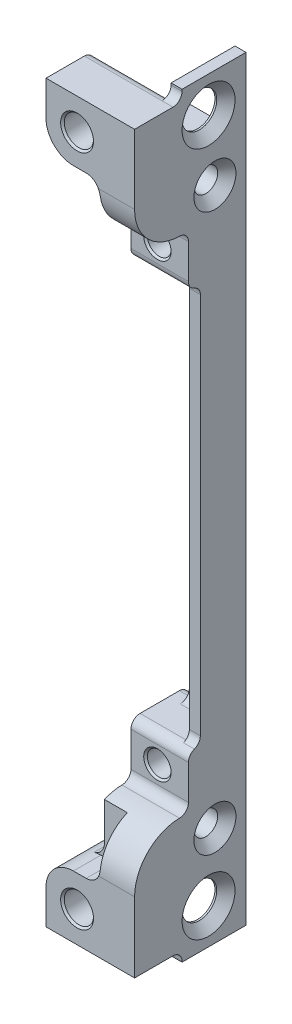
ISO-10303-21;
HEADER;
FILE_DESCRIPTION(('STEP AP214'),'2;1');
FILE_NAME('part.step','',(''),(''),'','','');
FILE_SCHEMA(('AUTOMOTIVE_DESIGN { 1 0 10303 214 1 1 1 1 }'));
ENDSEC;
DATA;
#1=APPLICATION_CONTEXT('core data for automotive mechanical design processes');
#2=APPLICATION_PROTOCOL_DEFINITION('international standard','automotive_design',2000,#1);
#3=PRODUCT_CONTEXT('',#1,'mechanical');
#4=PRODUCT('Part','Part','',(#3));
#5=PRODUCT_RELATED_PRODUCT_CATEGORY('part','',(#4));
#6=PRODUCT_DEFINITION_FORMATION('','',#4);
#7=PRODUCT_DEFINITION_CONTEXT('part definition',#1,'design');
#8=PRODUCT_DEFINITION('design','',#6,#7);
#9=PRODUCT_DEFINITION_SHAPE('','',#8);
#10=(LENGTH_UNIT() NAMED_UNIT(*) SI_UNIT(.MILLI.,.METRE.));
#11=(NAMED_UNIT(*) PLANE_ANGLE_UNIT() SI_UNIT($,.RADIAN.));
#12=(NAMED_UNIT(*) SI_UNIT($,.STERADIAN.) SOLID_ANGLE_UNIT());
#13=UNCERTAINTY_MEASURE_WITH_UNIT(LENGTH_MEASURE(1.E-05),#10,'distance_accuracy_value','');
#14=(GEOMETRIC_REPRESENTATION_CONTEXT(3) GLOBAL_UNCERTAINTY_ASSIGNED_CONTEXT((#13)) GLOBAL_UNIT_ASSIGNED_CONTEXT((#10,
#11,#12)) REPRESENTATION_CONTEXT('',''));
#15=CARTESIAN_POINT('',(0.,0.,0.));
#16=DIRECTION('',(0.,0.,1.));
#17=DIRECTION('',(1.,0.,0.));
#18=AXIS2_PLACEMENT_3D('',#15,#16,#17);
#19=CARTESIAN_POINT('',(-24.6,78.2,7.00000000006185));
#20=DIRECTION('',(0.,0.,-1.));
#21=DIRECTION('',(-1.,0.,0.));
#22=AXIS2_PLACEMENT_3D('',#19,#20,#21);
#23=CONICAL_SURFACE('',#22,1.79985429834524,0.785357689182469);
#24=CARTESIAN_POINT('',(-24.6,78.2,7.00000000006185));
#25=DIRECTION('',(0.,0.,-1.));
#26=DIRECTION('',(-1.,0.,0.));
#27=AXIS2_PLACEMENT_3D('',#24,#25,#26);
#28=CIRCLE('',#27,1.79985429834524);
#29=CARTESIAN_POINT('',(-26.3998542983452,78.2,7.00000000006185));
#30=VERTEX_POINT('',#29);
#31=EDGE_CURVE('E548',#30,#30,#28,.F.);
#32=ORIENTED_EDGE('',*,*,#31,.F.);
#33=EDGE_LOOP('',(#32));
#34=FACE_BOUND('',#33,.T.);
#35=CARTESIAN_POINT('',(-24.6,78.2,7.19987047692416));
#36=DIRECTION('',(0.,0.,-1.));
#37=DIRECTION('',(-1.,0.,0.));
#38=AXIS2_PLACEMENT_3D('',#35,#36,#37);
#39=CIRCLE('',#38,1.6);
#40=CARTESIAN_POINT('',(-26.2,78.2,7.19987047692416));
#41=VERTEX_POINT('',#40);
#42=EDGE_CURVE('E562',#41,#41,#39,.F.);
#43=ORIENTED_EDGE('',*,*,#42,.T.);
#44=EDGE_LOOP('',(#43));
#45=FACE_BOUND('',#44,.T.);
#46=ADVANCED_FACE('F16',(#34,#45),#23,.F.);
#47=CARTESIAN_POINT('',(-24.733704,62.2,2.2));
#48=DIRECTION('',(1.,0.,0.));
#49=DIRECTION('',(0.,0.,-1.));
#50=AXIS2_PLACEMENT_3D('',#47,#48,#49);
#51=CYLINDRICAL_SURFACE('',#50,1.);
#52=DIRECTION('',(1.,0.,0.));
#53=VECTOR('',#52,1.);
#54=CARTESIAN_POINT('',(-21.45,62.2,1.2));
#55=LINE('',#54,#53);
#56=CARTESIAN_POINT('',(-19.5,62.2,1.2));
#57=VERTEX_POINT('',#56);
#58=CARTESIAN_POINT('',(-23.3,62.2,1.2));
#59=VERTEX_POINT('',#58);
#60=EDGE_CURVE('E282',#57,#59,#55,.F.);
#61=ORIENTED_EDGE('',*,*,#60,.F.);
#62=CARTESIAN_POINT('',(-19.5,62.2,2.2));
#63=DIRECTION('',(1.,0.,0.));
#64=DIRECTION('',(0.,0.,-1.));
#65=AXIS2_PLACEMENT_3D('',#62,#63,#64);
#66=CIRCLE('',#65,1.);
#67=CARTESIAN_POINT('',(-19.5,63.2,2.2));
#68=VERTEX_POINT('',#67);
#69=EDGE_CURVE('E19',#68,#57,#66,.F.);
#70=ORIENTED_EDGE('',*,*,#69,.F.);
#71=DIRECTION('',(1.,0.,0.));
#72=VECTOR('',#71,1.);
#73=CARTESIAN_POINT('',(-18.3,63.2,2.2));
#74=LINE('',#73,#72);
#75=CARTESIAN_POINT('',(-23.3,63.2,2.2));
#76=VERTEX_POINT('',#75);
#77=EDGE_CURVE('E287',#68,#76,#74,.F.);
#78=ORIENTED_EDGE('',*,*,#77,.T.);
#79=CARTESIAN_POINT('',(-23.3,62.2,2.2));
#80=DIRECTION('',(1.,0.,0.));
#81=DIRECTION('',(0.,0.,-1.));
#82=AXIS2_PLACEMENT_3D('',#79,#80,#81);
#83=CIRCLE('',#82,1.);
#84=EDGE_CURVE('E280',#59,#76,#83,.T.);
#85=ORIENTED_EDGE('',*,*,#84,.F.);
#86=EDGE_LOOP('',(#61,#70,#78,#85));
#87=FACE_BOUND('',#86,.T.);
#88=ADVANCED_FACE('F283',(#87),#51,.F.);
#89=CARTESIAN_POINT('',(-24.6,4.5,7.00000000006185));
#90=DIRECTION('',(0.,0.,-1.));
#91=DIRECTION('',(-1.,0.,0.));
#92=AXIS2_PLACEMENT_3D('',#89,#90,#91);
#93=CONICAL_SURFACE('',#92,1.79985429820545,0.785357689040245);
#94=CARTESIAN_POINT('',(-24.6,4.5,7.000000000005));
#95=DIRECTION('',(0.,0.,-1.));
#96=DIRECTION('',(-1.,0.,0.));
#97=AXIS2_PLACEMENT_3D('',#94,#95,#96);
#98=CIRCLE('',#97,1.79985429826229);
#99=CARTESIAN_POINT('',(-26.3998542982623,4.5,7.000000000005));
#100=VERTEX_POINT('',#99);
#101=EDGE_CURVE('E532',#100,#100,#98,.F.);
#102=ORIENTED_EDGE('',*,*,#101,.F.);
#103=EDGE_LOOP('',(#102));
#104=FACE_BOUND('',#103,.T.);
#105=CARTESIAN_POINT('',(-24.6,4.5,7.19987047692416));
#106=DIRECTION('',(0.,0.,-1.));
#107=DIRECTION('',(-1.,0.,0.));
#108=AXIS2_PLACEMENT_3D('',#105,#106,#107);
#109=CIRCLE('',#108,1.6);
#110=CARTESIAN_POINT('',(-26.2,4.5,7.19987047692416));
#111=VERTEX_POINT('',#110);
#112=EDGE_CURVE('E578',#111,#111,#109,.F.);
#113=ORIENTED_EDGE('',*,*,#112,.T.);
#114=EDGE_LOOP('',(#113));
#115=FACE_BOUND('',#114,.T.);
#116=ADVANCED_FACE('F911',(#104,#115),#93,.F.);
#117=CARTESIAN_POINT('',(-19.352148,20.6,2.2));
#118=DIRECTION('',(-1.,0.,0.));
#119=DIRECTION('',(0.,0.,1.));
#120=AXIS2_PLACEMENT_3D('',#117,#118,#119);
#121=CYLINDRICAL_SURFACE('',#120,1.);
#122=DIRECTION('',(1.,0.,0.));
#123=VECTOR('',#122,1.);
#124=CARTESIAN_POINT('',(-18.3,19.6,2.2));
#125=LINE('',#124,#123);
#126=CARTESIAN_POINT('',(-23.3,19.6,2.2));
#127=VERTEX_POINT('',#126);
#128=CARTESIAN_POINT('',(-19.5,19.6,2.2));
#129=VERTEX_POINT('',#128);
#130=EDGE_CURVE('E541',#127,#129,#125,.T.);
#131=ORIENTED_EDGE('',*,*,#130,.T.);
#132=CARTESIAN_POINT('',(-19.5,20.6,2.2));
#133=DIRECTION('',(-1.,0.,0.));
#134=DIRECTION('',(0.,0.,1.));
#135=AXIS2_PLACEMENT_3D('',#132,#133,#134);
#136=CIRCLE('',#135,1.);
#137=CARTESIAN_POINT('',(-19.5,20.6,1.2));
#138=VERTEX_POINT('',#137);
#139=EDGE_CURVE('E1349',#138,#129,#136,.T.);
#140=ORIENTED_EDGE('',*,*,#139,.F.);
#141=DIRECTION('',(1.,0.,0.));
#142=VECTOR('',#141,1.);
#143=CARTESIAN_POINT('',(-21.45,20.6,1.2));
#144=LINE('',#143,#142);
#145=CARTESIAN_POINT('',(-23.3,20.6,1.2));
#146=VERTEX_POINT('',#145);
#147=EDGE_CURVE('E288',#146,#138,#144,.T.);
#148=ORIENTED_EDGE('',*,*,#147,.F.);
#149=CARTESIAN_POINT('',(-23.3,20.6,2.2));
#150=DIRECTION('',(-1.,0.,0.));
#151=DIRECTION('',(0.,0.,1.));
#152=AXIS2_PLACEMENT_3D('',#149,#150,#151);
#153=CIRCLE('',#152,1.);
#154=EDGE_CURVE('E587',#127,#146,#153,.F.);
#155=ORIENTED_EDGE('',*,*,#154,.F.);
#156=EDGE_LOOP('',(#131,#140,#148,#155));
#157=FACE_BOUND('',#156,.T.);
#158=ADVANCED_FACE('F907',(#157),#121,.F.);
#159=CARTESIAN_POINT('',(-28.,7.9,6.3));
#160=DIRECTION('',(0.,-1.,0.));
#161=DIRECTION('',(0.,0.,-1.));
#162=AXIS2_PLACEMENT_3D('',#159,#160,#161);
#163=PLANE('',#162);
#164=DIRECTION('',(0.,0.,-1.));
#165=VECTOR('',#164,1.);
#166=CARTESIAN_POINT('',(-25.,7.9,12.35648));
#167=LINE('',#166,#165);
#168=CARTESIAN_POINT('',(-25.,7.9,12.2));
#169=VERTEX_POINT('',#168);
#170=CARTESIAN_POINT('',(-25.,7.9,9.2));
#171=VERTEX_POINT('',#170);
#172=EDGE_CURVE('E499',#169,#171,#167,.T.);
#173=ORIENTED_EDGE('',*,*,#172,.F.);
#174=DIRECTION('',(1.,0.,0.));
#175=VECTOR('',#174,1.);
#176=CARTESIAN_POINT('',(-28.,7.9,12.2));
#177=LINE('',#176,#175);
#178=CARTESIAN_POINT('',(-23.6,7.9,12.2));
#179=VERTEX_POINT('',#178);
#180=EDGE_CURVE('E582',#179,#169,#177,.F.);
#181=ORIENTED_EDGE('',*,*,#180,.F.);
#182=DIRECTION('',(0.,0.,-1.));
#183=VECTOR('',#182,1.);
#184=CARTESIAN_POINT('',(-23.6,7.9,12.35648));
#185=LINE('',#184,#183);
#186=CARTESIAN_POINT('',(-23.6,7.9,9.2));
#187=VERTEX_POINT('',#186);
#188=EDGE_CURVE('E494',#179,#187,#185,.T.);
#189=ORIENTED_EDGE('',*,*,#188,.T.);
#190=DIRECTION('',(-1.,0.,0.));
#191=VECTOR('',#190,1.);
#192=CARTESIAN_POINT('',(-24.6,7.9,9.2));
#193=LINE('',#192,#191);
#194=EDGE_CURVE('E506',#187,#171,#193,.T.);
#195=ORIENTED_EDGE('',*,*,#194,.T.);
#196=EDGE_LOOP('',(#173,#181,#189,#195));
#197=FACE_BOUND('',#196,.T.);
#198=ADVANCED_FACE('F903',(#197),#163,.F.);
#199=CARTESIAN_POINT('',(-24.6,4.5,0.));
#200=DIRECTION('',(0.,0.,-1.));
#201=DIRECTION('',(-1.,0.,0.));
#202=AXIS2_PLACEMENT_3D('',#199,#200,#201);
#203=CYLINDRICAL_SURFACE('',#202,1.6);
#204=ORIENTED_EDGE('',*,*,#112,.F.);
#205=EDGE_LOOP('',(#204));
#206=FACE_BOUND('',#205,.T.);
#207=CARTESIAN_POINT('',(-24.6,4.5,12.0001295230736));
#208=DIRECTION('',(0.,0.,1.));
#209=DIRECTION('',(0.,-1.,0.));
#210=AXIS2_PLACEMENT_3D('',#207,#208,#209);
#211=CIRCLE('',#210,1.59999999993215);
#212=CARTESIAN_POINT('',(-24.6,2.90000000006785,12.0001295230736));
#213=VERTEX_POINT('',#212);
#214=EDGE_CURVE('E484',#213,#213,#211,.T.);
#215=ORIENTED_EDGE('',*,*,#214,.T.);
#216=EDGE_LOOP('',(#215));
#217=FACE_BOUND('',#216,.T.);
#218=ADVANCED_FACE('F899',(#206,#217),#203,.F.);
#219=CARTESIAN_POINT('',(-19.32950484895,7.,6.));
#220=DIRECTION('',(-1.,0.,0.));
#221=DIRECTION('',(0.,0.,1.));
#222=AXIS2_PLACEMENT_3D('',#219,#220,#221);
#223=CYLINDRICAL_SURFACE('',#222,1.);
#224=CARTESIAN_POINT('',(-24.6,7.,6.));
#225=DIRECTION('',(-1.,0.,0.));
#226=DIRECTION('',(0.,0.,1.));
#227=AXIS2_PLACEMENT_3D('',#224,#225,#226);
#228=CIRCLE('',#227,1.);
#229=CARTESIAN_POINT('',(-24.6,8.,6.));
#230=VERTEX_POINT('',#229);
#231=CARTESIAN_POINT('',(-24.6,7.,7.));
#232=VERTEX_POINT('',#231);
#233=EDGE_CURVE('E1354',#230,#232,#228,.F.);
#234=ORIENTED_EDGE('',*,*,#233,.F.);
#235=DIRECTION('',(1.,0.,0.));
#236=VECTOR('',#235,1.);
#237=CARTESIAN_POINT('',(-24.6,8.,6.));
#238=LINE('',#237,#236);
#239=CARTESIAN_POINT('',(-19.5,8.,6.));
#240=VERTEX_POINT('',#239);
#241=EDGE_CURVE('E453',#230,#240,#238,.T.);
#242=ORIENTED_EDGE('',*,*,#241,.T.);
#243=CARTESIAN_POINT('',(-19.5,7.,6.));
#244=DIRECTION('',(-1.,0.,0.));
#245=DIRECTION('',(0.,0.,1.));
#246=AXIS2_PLACEMENT_3D('',#243,#244,#245);
#247=CIRCLE('',#246,1.);
#248=CARTESIAN_POINT('',(-19.5,7.,7.));
#249=VERTEX_POINT('',#248);
#250=EDGE_CURVE('E581',#249,#240,#247,.T.);
#251=ORIENTED_EDGE('',*,*,#250,.F.);
#252=DIRECTION('',(-1.,0.,0.));
#253=VECTOR('',#252,1.);
#254=CARTESIAN_POINT('',(-23.15,7.,7.));
#255=LINE('',#254,#253);
#256=EDGE_CURVE('E529',#232,#249,#255,.F.);
#257=ORIENTED_EDGE('',*,*,#256,.F.);
#258=EDGE_LOOP('',(#234,#242,#251,#257));
#259=FACE_BOUND('',#258,.T.);
#260=ADVANCED_FACE('F895',(#259),#223,.F.);
#261=CARTESIAN_POINT('',(-28.15601797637,75.8,6.));
#262=DIRECTION('',(1.,0.,0.));
#263=DIRECTION('',(0.,0.,-1.));
#264=AXIS2_PLACEMENT_3D('',#261,#262,#263);
#265=CYLINDRICAL_SURFACE('',#264,1.);
#266=DIRECTION('',(1.,0.,0.));
#267=VECTOR('',#266,1.);
#268=CARTESIAN_POINT('',(-19.5,74.8,6.));
#269=LINE('',#268,#267);
#270=CARTESIAN_POINT('',(-19.5,74.8,6.));
#271=VERTEX_POINT('',#270);
#272=CARTESIAN_POINT('',(-24.6,74.8,6.));
#273=VERTEX_POINT('',#272);
#274=EDGE_CURVE('E553',#271,#273,#269,.F.);
#275=ORIENTED_EDGE('',*,*,#274,.T.);
#276=CARTESIAN_POINT('',(-24.6,75.8,6.));
#277=DIRECTION('',(1.,0.,0.));
#278=DIRECTION('',(0.,0.,-1.));
#279=AXIS2_PLACEMENT_3D('',#276,#277,#278);
#280=CIRCLE('',#279,1.);
#281=CARTESIAN_POINT('',(-24.6,75.8,7.));
#282=VERTEX_POINT('',#281);
#283=EDGE_CURVE('E1356',#282,#273,#280,.T.);
#284=ORIENTED_EDGE('',*,*,#283,.F.);
#285=DIRECTION('',(-1.,0.,0.));
#286=VECTOR('',#285,1.);
#287=CARTESIAN_POINT('',(-23.15,75.8,7.));
#288=LINE('',#287,#286);
#289=CARTESIAN_POINT('',(-19.5,75.8,7.));
#290=VERTEX_POINT('',#289);
#291=EDGE_CURVE('E545',#290,#282,#288,.T.);
#292=ORIENTED_EDGE('',*,*,#291,.F.);
#293=CARTESIAN_POINT('',(-19.5,75.8,6.));
#294=DIRECTION('',(1.,0.,0.));
#295=DIRECTION('',(0.,0.,-1.));
#296=AXIS2_PLACEMENT_3D('',#293,#294,#295);
#297=CIRCLE('',#296,1.);
#298=EDGE_CURVE('E573',#271,#290,#297,.F.);
#299=ORIENTED_EDGE('',*,*,#298,.F.);
#300=EDGE_LOOP('',(#275,#284,#292,#299));
#301=FACE_BOUND('',#300,.T.);
#302=ADVANCED_FACE('F891',(#301),#265,.F.);
#303=CARTESIAN_POINT('',(-28.,74.8,13.3));
#304=DIRECTION('',(0.,1.,0.));
#305=DIRECTION('',(0.,0.,1.));
#306=AXIS2_PLACEMENT_3D('',#303,#304,#305);
#307=PLANE('',#306);
#308=DIRECTION('',(0.,0.,1.));
#309=VECTOR('',#308,1.);
#310=CARTESIAN_POINT('',(-23.6,74.8,9.049196));
#311=LINE('',#310,#309);
#312=CARTESIAN_POINT('',(-23.6,74.8,9.2));
#313=VERTEX_POINT('',#312);
#314=CARTESIAN_POINT('',(-23.6,74.8,12.2));
#315=VERTEX_POINT('',#314);
#316=EDGE_CURVE('E558',#313,#315,#311,.T.);
#317=ORIENTED_EDGE('',*,*,#316,.T.);
#318=DIRECTION('',(1.,0.,0.));
#319=VECTOR('',#318,1.);
#320=CARTESIAN_POINT('',(-28.,74.8,12.2));
#321=LINE('',#320,#319);
#322=CARTESIAN_POINT('',(-25.,74.8,12.2));
#323=VERTEX_POINT('',#322);
#324=EDGE_CURVE('E571',#323,#315,#321,.T.);
#325=ORIENTED_EDGE('',*,*,#324,.F.);
#326=DIRECTION('',(0.,0.,1.));
#327=VECTOR('',#326,1.);
#328=CARTESIAN_POINT('',(-25.,74.8,6.849196));
#329=LINE('',#328,#327);
#330=CARTESIAN_POINT('',(-25.,74.8,9.2));
#331=VERTEX_POINT('',#330);
#332=EDGE_CURVE('E348',#331,#323,#329,.T.);
#333=ORIENTED_EDGE('',*,*,#332,.F.);
#334=DIRECTION('',(1.,0.,0.));
#335=VECTOR('',#334,1.);
#336=CARTESIAN_POINT('',(-28.,74.8,9.2));
#337=LINE('',#336,#335);
#338=EDGE_CURVE('E567',#313,#331,#337,.F.);
#339=ORIENTED_EDGE('',*,*,#338,.F.);
#340=EDGE_LOOP('',(#317,#325,#333,#339));
#341=FACE_BOUND('',#340,.T.);
#342=ADVANCED_FACE('F887',(#341),#307,.F.);
#343=CARTESIAN_POINT('',(-24.6,78.2,0.));
#344=DIRECTION('',(0.,0.,-1.));
#345=DIRECTION('',(-1.,0.,0.));
#346=AXIS2_PLACEMENT_3D('',#343,#344,#345);
#347=CYLINDRICAL_SURFACE('',#346,1.6);
#348=ORIENTED_EDGE('',*,*,#42,.F.);
#349=EDGE_LOOP('',(#348));
#350=FACE_BOUND('',#349,.T.);
#351=CARTESIAN_POINT('',(-24.6,78.2,12.0001295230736));
#352=DIRECTION('',(0.,0.,1.));
#353=DIRECTION('',(0.,-1.,0.));
#354=AXIS2_PLACEMENT_3D('',#351,#352,#353);
#355=CIRCLE('',#354,1.6000000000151);
#356=CARTESIAN_POINT('',(-24.6,76.5999999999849,12.0001295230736));
#357=VERTEX_POINT('',#356);
#358=EDGE_CURVE('E342',#357,#357,#355,.T.);
#359=ORIENTED_EDGE('',*,*,#358,.T.);
#360=EDGE_LOOP('',(#359));
#361=FACE_BOUND('',#360,.T.);
#362=ADVANCED_FACE('F882',(#350,#361),#347,.F.);
#363=CARTESIAN_POINT('',(-23.6,73.3,9.049196));
#364=DIRECTION('',(0.,0.,1.));
#365=DIRECTION('',(1.,0.,0.));
#366=AXIS2_PLACEMENT_3D('',#363,#364,#365);
#367=CYLINDRICAL_SURFACE('',#366,1.5);
#368=CARTESIAN_POINT('',(-22.2729106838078,73.9991666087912,12.2));
#369=CARTESIAN_POINT('',(-22.2537116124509,73.9627220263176,12.2000009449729));
#370=CARTESIAN_POINT('',(-22.2360243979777,73.9255086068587,12.1996007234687));
#371=CARTESIAN_POINT('',(-22.2037675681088,73.8497580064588,12.1979110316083));
#372=CARTESIAN_POINT('',(-22.1891990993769,73.8112203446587,12.1966212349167));
#373=CARTESIAN_POINT('',(-22.1508991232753,73.6956930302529,12.1913651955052));
#374=CARTESIAN_POINT('',(-22.1317270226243,73.6171729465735,12.1860190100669));
#375=CARTESIAN_POINT('',(-22.1126819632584,73.4986806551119,12.1750458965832));
#376=CARTESIAN_POINT('',(-22.1079523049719,73.4592676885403,12.170924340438));
#377=CARTESIAN_POINT('',(-22.1015955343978,73.3798891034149,12.1616639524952));
#378=CARTESIAN_POINT('',(-22.1000014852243,73.3399220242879,12.1565149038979));
#379=CARTESIAN_POINT('',(-22.1,73.3000000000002,12.1508752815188));
#380=B_SPLINE_CURVE_WITH_KNOTS('',3,(#368,#369,#370,#371,#372,#373,#374,#375,#376,#377,#378,
#379),.UNSPECIFIED.,.F.,.F.,(4,2,2,2,2,4),(0.,0.123490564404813,0.247026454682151,
0.48869320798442,0.608310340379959,0.729182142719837),.UNSPECIFIED.);
#381=CARTESIAN_POINT('',(-22.2729106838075,73.9991666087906,12.2));
#382=VERTEX_POINT('',#381);
#383=CARTESIAN_POINT('',(-22.1,73.3000000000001,12.1508752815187));
#384=VERTEX_POINT('',#383);
#385=EDGE_CURVE('E549',#382,#384,#380,.T.);
#386=ORIENTED_EDGE('',*,*,#385,.F.);
#387=CARTESIAN_POINT('',(-23.6,73.3,12.2));
#388=DIRECTION('',(0.,0.,1.));
#389=DIRECTION('',(1.,0.,0.));
#390=AXIS2_PLACEMENT_3D('',#387,#388,#389);
#391=CIRCLE('',#390,1.5);
#392=EDGE_CURVE('E561',#315,#382,#391,.F.);
#393=ORIENTED_EDGE('',*,*,#392,.F.);
#394=ORIENTED_EDGE('',*,*,#316,.F.);
#395=CARTESIAN_POINT('',(-23.6,73.3,9.2));
#396=DIRECTION('',(0.,0.,1.));
#397=DIRECTION('',(1.,0.,0.));
#398=AXIS2_PLACEMENT_3D('',#395,#396,#397);
#399=CIRCLE('',#398,1.5);
#400=CARTESIAN_POINT('',(-22.1,73.3,9.2));
#401=VERTEX_POINT('',#400);
#402=EDGE_CURVE('E337',#313,#401,#399,.F.);
#403=ORIENTED_EDGE('',*,*,#402,.T.);
#404=DIRECTION('',(0.,0.,1.));
#405=VECTOR('',#404,1.);
#406=CARTESIAN_POINT('',(-22.1,73.3,6.1));
#407=LINE('',#406,#405);
#408=EDGE_CURVE('E338',#384,#401,#407,.F.);
#409=ORIENTED_EDGE('',*,*,#408,.F.);
#410=EDGE_LOOP('',(#386,#393,#394,#403,#409));
#411=FACE_BOUND('',#410,.T.);
#412=ADVANCED_FACE('F876',(#411),#367,.F.);
#413=CARTESIAN_POINT('',(-23.15,41.4,7.));
#414=DIRECTION('',(0.,0.,-1.));
#415=DIRECTION('',(-1.,0.,0.));
#416=AXIS2_PLACEMENT_3D('',#413,#414,#415);
#417=PLANE('',#416);
#418=ORIENTED_EDGE('',*,*,#31,.T.);
#419=EDGE_LOOP('',(#418));
#420=FACE_BOUND('',#419,.T.);
#421=DIRECTION('',(0.,1.,0.));
#422=VECTOR('',#421,1.);
#423=CARTESIAN_POINT('',(-24.6,74.8,7.));
#424=LINE('',#423,#422);
#425=CARTESIAN_POINT('',(-24.6,73.43651515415,7.));
#426=VERTEX_POINT('',#425);
#427=EDGE_CURVE('E312',#282,#426,#424,.F.);
#428=ORIENTED_EDGE('',*,*,#427,.T.);
#429=CARTESIAN_POINT('',(-26.1,73.43651515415,7.));
#430=DIRECTION('',(0.,0.,1.));
#431=DIRECTION('',(1.,0.,0.));
#432=AXIS2_PLACEMENT_3D('',#429,#430,#431);
#433=CIRCLE('',#432,1.5);
#434=CARTESIAN_POINT('',(-25.7333333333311,74.8910101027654,7.));
#435=VERTEX_POINT('',#434);
#436=EDGE_CURVE('E539',#426,#435,#433,.T.);
#437=ORIENTED_EDGE('',*,*,#436,.T.);
#438=CARTESIAN_POINT('',(-25.,77.8,7.));
#439=DIRECTION('',(0.,0.,1.));
#440=DIRECTION('',(1.,0.,0.));
#441=AXIS2_PLACEMENT_3D('',#438,#439,#440);
#442=CIRCLE('',#441,3.);
#443=CARTESIAN_POINT('',(-28.,77.8,7.));
#444=VERTEX_POINT('',#443);
#445=EDGE_CURVE('E345',#444,#435,#442,.T.);
#446=ORIENTED_EDGE('',*,*,#445,.F.);
#447=DIRECTION('',(0.,1.,0.));
#448=VECTOR('',#447,1.);
#449=CARTESIAN_POINT('',(-28.,82.8,7.));
#450=LINE('',#449,#448);
#451=CARTESIAN_POINT('',(-28.,80.6,7.));
#452=VERTEX_POINT('',#451);
#453=EDGE_CURVE('E355',#452,#444,#450,.F.);
#454=ORIENTED_EDGE('',*,*,#453,.F.);
#455=DIRECTION('',(-1.,0.,0.));
#456=VECTOR('',#455,1.);
#457=CARTESIAN_POINT('',(-28.,80.6,7.));
#458=LINE('',#457,#456);
#459=CARTESIAN_POINT('',(-19.5,80.6,7.));
#460=VERTEX_POINT('',#459);
#461=EDGE_CURVE('E574',#460,#452,#458,.T.);
#462=ORIENTED_EDGE('',*,*,#461,.F.);
#463=DIRECTION('',(0.,1.,0.));
#464=VECTOR('',#463,1.);
#465=CARTESIAN_POINT('',(-19.5,82.8,7.));
#466=LINE('',#465,#464);
#467=EDGE_CURVE('E383',#460,#290,#466,.F.);
#468=ORIENTED_EDGE('',*,*,#467,.T.);
#469=ORIENTED_EDGE('',*,*,#291,.T.);
#470=EDGE_LOOP('',(#428,#437,#446,#454,#462,#468,#469));
#471=FACE_BOUND('',#470,.T.);
#472=ADVANCED_FACE('F881',(#420,#471),#417,.T.);
#473=CARTESIAN_POINT('',(-26.1,73.43651515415,-0.187913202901));
#474=DIRECTION('',(0.,0.,1.));
#475=DIRECTION('',(1.,0.,0.));
#476=AXIS2_PLACEMENT_3D('',#473,#474,#475);
#477=CYLINDRICAL_SURFACE('',#476,1.5);
#478=CARTESIAN_POINT('',(-26.1,73.43651515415,9.2));
#479=DIRECTION('',(0.,0.,1.));
#480=DIRECTION('',(1.,0.,0.));
#481=AXIS2_PLACEMENT_3D('',#478,#479,#480);
#482=CIRCLE('',#481,1.5);
#483=CARTESIAN_POINT('',(-24.6,73.43651515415,9.2));
#484=VERTEX_POINT('',#483);
#485=CARTESIAN_POINT('',(-25.7333333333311,74.8910101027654,9.2));
#486=VERTEX_POINT('',#485);
#487=EDGE_CURVE('E341',#484,#486,#482,.T.);
#488=ORIENTED_EDGE('',*,*,#487,.T.);
#489=DIRECTION('',(0.,0.,1.));
#490=VECTOR('',#489,1.);
#491=CARTESIAN_POINT('',(-25.7333333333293,74.8910101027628,6.849196));
#492=LINE('',#491,#490);
#493=EDGE_CURVE('E352',#435,#486,#492,.T.);
#494=ORIENTED_EDGE('',*,*,#493,.F.);
#495=ORIENTED_EDGE('',*,*,#436,.F.);
#496=DIRECTION('',(0.,0.,-1.));
#497=VECTOR('',#496,1.);
#498=CARTESIAN_POINT('',(-24.6,73.43651515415,0.));
#499=LINE('',#498,#497);
#500=EDGE_CURVE('E314',#426,#484,#499,.F.);
#501=ORIENTED_EDGE('',*,*,#500,.T.);
#502=EDGE_LOOP('',(#488,#494,#495,#501));
#503=FACE_BOUND('',#502,.T.);
#504=ADVANCED_FACE('F1380',(#503),#477,.F.);
#505=CARTESIAN_POINT('',(-21.7,66.1,0.));
#506=DIRECTION('',(0.,0.,-1.));
#507=DIRECTION('',(-1.,0.,0.));
#508=AXIS2_PLACEMENT_3D('',#505,#506,#507);
#509=CYLINDRICAL_SURFACE('',#508,1.3);
#510=CARTESIAN_POINT('',(-21.7,66.1,1.00016099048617));
#511=DIRECTION('',(0.,0.,-1.));
#512=DIRECTION('',(0.,-1.,0.));
#513=AXIS2_PLACEMENT_3D('',#510,#511,#512);
#514=CIRCLE('',#513,1.29999999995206);
#515=CARTESIAN_POINT('',(-21.7,64.8000000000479,1.00016099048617));
#516=VERTEX_POINT('',#515);
#517=EDGE_CURVE('E399',#516,#516,#514,.T.);
#518=ORIENTED_EDGE('',*,*,#517,.T.);
#519=EDGE_LOOP('',(#518));
#520=FACE_BOUND('',#519,.T.);
#521=CARTESIAN_POINT('',(-21.7,66.1,6.10000016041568));
#522=DIRECTION('',(0.,0.,1.));
#523=DIRECTION('',(0.,-1.,0.));
#524=AXIS2_PLACEMENT_3D('',#521,#522,#523);
#525=CIRCLE('',#524,1.30000000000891);
#526=CARTESIAN_POINT('',(-21.7,64.7999999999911,6.10000016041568));
#527=VERTEX_POINT('',#526);
#528=EDGE_CURVE('E302',#527,#527,#525,.T.);
#529=ORIENTED_EDGE('',*,*,#528,.T.);
#530=EDGE_LOOP('',(#529));
#531=FACE_BOUND('',#530,.T.);
#532=ADVANCED_FACE('F1429',(#520,#531),#509,.F.);
#533=CARTESIAN_POINT('',(-21.45,41.4,1.2));
#534=DIRECTION('',(0.,0.,1.));
#535=DIRECTION('',(1.,0.,0.));
#536=AXIS2_PLACEMENT_3D('',#533,#534,#535);
#537=PLANE('',#536);
#538=DIRECTION('',(0.,1.,0.));
#539=VECTOR('',#538,1.);
#540=CARTESIAN_POINT('',(-19.5,19.6,1.2));
#541=LINE('',#540,#539);
#542=EDGE_CURVE('E277',#138,#57,#541,.T.);
#543=ORIENTED_EDGE('',*,*,#542,.T.);
#544=ORIENTED_EDGE('',*,*,#60,.T.);
#545=DIRECTION('',(0.,1.,0.));
#546=VECTOR('',#545,1.);
#547=CARTESIAN_POINT('',(-23.3,41.4,1.2));
#548=LINE('',#547,#546);
#549=EDGE_CURVE('E411',#146,#59,#548,.T.);
#550=ORIENTED_EDGE('',*,*,#549,.F.);
#551=ORIENTED_EDGE('',*,*,#147,.T.);
#552=EDGE_LOOP('',(#543,#544,#550,#551));
#553=FACE_BOUND('',#552,.T.);
#554=ADVANCED_FACE('F291',(#553),#537,.T.);
#555=CARTESIAN_POINT('',(-18.3,63.2,5.));
#556=DIRECTION('',(0.,1.,0.));
#557=DIRECTION('',(0.,0.,1.));
#558=AXIS2_PLACEMENT_3D('',#555,#556,#557);
#559=PLANE('',#558);
#560=DIRECTION('',(0.,0.,1.));
#561=VECTOR('',#560,1.);
#562=CARTESIAN_POINT('',(-23.3,63.2,3.96952341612));
#563=LINE('',#562,#561);
#564=CARTESIAN_POINT('',(-23.3,63.2,1.));
#565=VERTEX_POINT('',#564);
#566=EDGE_CURVE('E407',#76,#565,#563,.F.);
#567=ORIENTED_EDGE('',*,*,#566,.F.);
#568=ORIENTED_EDGE('',*,*,#77,.F.);
#569=DIRECTION('',(0.,0.,-1.));
#570=VECTOR('',#569,1.);
#571=CARTESIAN_POINT('',(-19.5,63.2,5.));
#572=LINE('',#571,#570);
#573=CARTESIAN_POINT('',(-19.5,63.2,5.3));
#574=VERTEX_POINT('',#573);
#575=EDGE_CURVE('E279',#68,#574,#572,.F.);
#576=ORIENTED_EDGE('',*,*,#575,.T.);
#577=DIRECTION('',(1.,0.,0.));
#578=VECTOR('',#577,1.);
#579=CARTESIAN_POINT('',(-24.733704,63.2,5.3));
#580=LINE('',#579,#578);
#581=CARTESIAN_POINT('',(-24.6,63.2,5.3));
#582=VERTEX_POINT('',#581);
#583=EDGE_CURVE('E327',#582,#574,#580,.T.);
#584=ORIENTED_EDGE('',*,*,#583,.F.);
#585=DIRECTION('',(0.,0.,-1.));
#586=VECTOR('',#585,1.);
#587=CARTESIAN_POINT('',(-24.6,63.2,0.));
#588=LINE('',#587,#586);
#589=CARTESIAN_POINT('',(-24.6,63.2,1.));
#590=VERTEX_POINT('',#589);
#591=EDGE_CURVE('E321',#582,#590,#588,.T.);
#592=ORIENTED_EDGE('',*,*,#591,.T.);
#593=DIRECTION('',(-1.,0.,0.));
#594=VECTOR('',#593,1.);
#595=CARTESIAN_POINT('',(-19.269192,63.2,1.));
#596=LINE('',#595,#594);
#597=EDGE_CURVE('E416',#565,#590,#596,.T.);
#598=ORIENTED_EDGE('',*,*,#597,.F.);
#599=EDGE_LOOP('',(#567,#568,#576,#584,#592,#598));
#600=FACE_BOUND('',#599,.T.);
#601=ADVANCED_FACE('F1346',(#600),#559,.F.);
#602=CARTESIAN_POINT('',(-23.15,41.4,7.));
#603=DIRECTION('',(0.,0.,-1.));
#604=DIRECTION('',(-1.,0.,0.));
#605=AXIS2_PLACEMENT_3D('',#602,#603,#604);
#606=PLANE('',#605);
#607=ORIENTED_EDGE('',*,*,#101,.T.);
#608=EDGE_LOOP('',(#607));
#609=FACE_BOUND('',#608,.T.);
#610=CARTESIAN_POINT('',(-25.,4.9,7.));
#611=DIRECTION('',(0.,0.,-1.));
#612=DIRECTION('',(-1.,0.,0.));
#613=AXIS2_PLACEMENT_3D('',#610,#611,#612);
#614=CIRCLE('',#613,3.);
#615=CARTESIAN_POINT('',(-25.7333333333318,7.80898989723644,7.));
#616=VERTEX_POINT('',#615);
#617=CARTESIAN_POINT('',(-28.,4.9,7.));
#618=VERTEX_POINT('',#617);
#619=EDGE_CURVE('E502',#616,#618,#614,.F.);
#620=ORIENTED_EDGE('',*,*,#619,.F.);
#621=CARTESIAN_POINT('',(-26.1,9.263484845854,7.));
#622=DIRECTION('',(0.,0.,-1.));
#623=DIRECTION('',(-1.,0.,0.));
#624=AXIS2_PLACEMENT_3D('',#621,#622,#623);
#625=CIRCLE('',#624,1.5);
#626=CARTESIAN_POINT('',(-24.6,9.263484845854,7.));
#627=VERTEX_POINT('',#626);
#628=EDGE_CURVE('E544',#616,#627,#625,.F.);
#629=ORIENTED_EDGE('',*,*,#628,.T.);
#630=DIRECTION('',(0.,1.,0.));
#631=VECTOR('',#630,1.);
#632=CARTESIAN_POINT('',(-24.6,74.8,7.));
#633=LINE('',#632,#631);
#634=EDGE_CURVE('E975',#627,#232,#633,.F.);
#635=ORIENTED_EDGE('',*,*,#634,.T.);
#636=ORIENTED_EDGE('',*,*,#256,.T.);
#637=DIRECTION('',(0.,1.,0.));
#638=VECTOR('',#637,1.);
#639=CARTESIAN_POINT('',(-19.5,8.,7.));
#640=LINE('',#639,#638);
#641=CARTESIAN_POINT('',(-19.5,2.1,7.));
#642=VERTEX_POINT('',#641);
#643=EDGE_CURVE('E447',#249,#642,#640,.F.);
#644=ORIENTED_EDGE('',*,*,#643,.T.);
#645=DIRECTION('',(-1.,0.,0.));
#646=VECTOR('',#645,1.);
#647=CARTESIAN_POINT('',(-28.,2.1,7.));
#648=LINE('',#647,#646);
#649=CARTESIAN_POINT('',(-28.,2.1,7.));
#650=VERTEX_POINT('',#649);
#651=EDGE_CURVE('E487',#650,#642,#648,.F.);
#652=ORIENTED_EDGE('',*,*,#651,.F.);
#653=DIRECTION('',(0.,1.,0.));
#654=VECTOR('',#653,1.);
#655=CARTESIAN_POINT('',(-28.,82.8,7.));
#656=LINE('',#655,#654);
#657=EDGE_CURVE('E479',#618,#650,#656,.F.);
#658=ORIENTED_EDGE('',*,*,#657,.F.);
#659=EDGE_LOOP('',(#620,#629,#635,#636,#644,#652,#658));
#660=FACE_BOUND('',#659,.T.);
#661=ADVANCED_FACE('F1249',(#609,#660),#606,.T.);
#662=CARTESIAN_POINT('',(-26.1,9.263484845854,12.35510132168));
#663=DIRECTION('',(0.,0.,-1.));
#664=DIRECTION('',(-1.,0.,0.));
#665=AXIS2_PLACEMENT_3D('',#662,#663,#664);
#666=CYLINDRICAL_SURFACE('',#665,1.5);
#667=DIRECTION('',(0.,0.,-1.));
#668=VECTOR('',#667,1.);
#669=CARTESIAN_POINT('',(-24.6,9.263484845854,0.));
#670=LINE('',#669,#668);
#671=CARTESIAN_POINT('',(-24.6,9.263484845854,9.2));
#672=VERTEX_POINT('',#671);
#673=EDGE_CURVE('E519',#672,#627,#670,.T.);
#674=ORIENTED_EDGE('',*,*,#673,.T.);
#675=ORIENTED_EDGE('',*,*,#628,.F.);
#676=DIRECTION('',(0.,0.,-1.));
#677=VECTOR('',#676,1.);
#678=CARTESIAN_POINT('',(-25.7333333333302,7.80898989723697,12.35648));
#679=LINE('',#678,#677);
#680=CARTESIAN_POINT('',(-25.7333333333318,7.80898989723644,9.2));
#681=VERTEX_POINT('',#680);
#682=EDGE_CURVE('E505',#681,#616,#679,.T.);
#683=ORIENTED_EDGE('',*,*,#682,.F.);
#684=CARTESIAN_POINT('',(-26.1,9.263484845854,9.2));
#685=DIRECTION('',(0.,0.,-1.));
#686=DIRECTION('',(-1.,0.,0.));
#687=AXIS2_PLACEMENT_3D('',#684,#685,#686);
#688=CIRCLE('',#687,1.5);
#689=EDGE_CURVE('E513',#681,#672,#688,.F.);
#690=ORIENTED_EDGE('',*,*,#689,.T.);
#691=EDGE_LOOP('',(#674,#675,#683,#690));
#692=FACE_BOUND('',#691,.T.);
#693=ADVANCED_FACE('F1240',(#692),#666,.F.);
#694=CARTESIAN_POINT('',(-18.3,19.6,6.3));
#695=DIRECTION('',(0.,-1.,0.));
#696=DIRECTION('',(0.,0.,-1.));
#697=AXIS2_PLACEMENT_3D('',#694,#695,#696);
#698=PLANE('',#697);
#699=DIRECTION('',(0.,0.,-1.));
#700=VECTOR('',#699,1.);
#701=CARTESIAN_POINT('',(-24.6,19.6,0.));
#702=LINE('',#701,#700);
#703=CARTESIAN_POINT('',(-24.6,19.6,1.));
#704=VERTEX_POINT('',#703);
#705=CARTESIAN_POINT('',(-24.6,19.6,5.3));
#706=VERTEX_POINT('',#705);
#707=EDGE_CURVE('E979',#704,#706,#702,.F.);
#708=ORIENTED_EDGE('',*,*,#707,.T.);
#709=DIRECTION('',(1.,0.,0.));
#710=VECTOR('',#709,1.);
#711=CARTESIAN_POINT('',(-24.733704,19.6,5.3));
#712=LINE('',#711,#710);
#713=CARTESIAN_POINT('',(-19.5,19.6,5.3));
#714=VERTEX_POINT('',#713);
#715=EDGE_CURVE('E514',#714,#706,#712,.F.);
#716=ORIENTED_EDGE('',*,*,#715,.F.);
#717=DIRECTION('',(0.,0.,-1.));
#718=VECTOR('',#717,1.);
#719=CARTESIAN_POINT('',(-19.5,19.6,5.));
#720=LINE('',#719,#718);
#721=EDGE_CURVE('E293',#714,#129,#720,.T.);
#722=ORIENTED_EDGE('',*,*,#721,.T.);
#723=ORIENTED_EDGE('',*,*,#130,.F.);
#724=DIRECTION('',(0.,0.,1.));
#725=VECTOR('',#724,1.);
#726=CARTESIAN_POINT('',(-23.3,19.6,3.96952341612));
#727=LINE('',#726,#725);
#728=CARTESIAN_POINT('',(-23.3,19.6,1.));
#729=VERTEX_POINT('',#728);
#730=EDGE_CURVE('E413',#729,#127,#727,.T.);
#731=ORIENTED_EDGE('',*,*,#730,.F.);
#732=DIRECTION('',(1.,0.,0.));
#733=VECTOR('',#732,1.);
#734=CARTESIAN_POINT('',(-24.733704,19.6,1.));
#735=LINE('',#734,#733);
#736=EDGE_CURVE('E524',#704,#729,#735,.T.);
#737=ORIENTED_EDGE('',*,*,#736,.F.);
#738=EDGE_LOOP('',(#708,#716,#722,#723,#731,#737));
#739=FACE_BOUND('',#738,.T.);
#740=ADVANCED_FACE('F1395',(#739),#698,.F.);
#741=CARTESIAN_POINT('',(-21.7,16.7,0.));
#742=DIRECTION('',(0.,0.,-1.));
#743=DIRECTION('',(-1.,0.,0.));
#744=AXIS2_PLACEMENT_3D('',#741,#742,#743);
#745=CYLINDRICAL_SURFACE('',#744,1.3);
#746=CARTESIAN_POINT('',(-21.7,16.7,1.00016099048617));
#747=DIRECTION('',(0.,0.,-1.));
#748=DIRECTION('',(0.,-1.,0.));
#749=AXIS2_PLACEMENT_3D('',#746,#747,#748);
#750=CIRCLE('',#749,1.30000000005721);
#751=CARTESIAN_POINT('',(-21.7,15.3999999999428,1.00016099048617));
#752=VERTEX_POINT('',#751);
#753=EDGE_CURVE('E396',#752,#752,#750,.T.);
#754=ORIENTED_EDGE('',*,*,#753,.T.);
#755=EDGE_LOOP('',(#754));
#756=FACE_BOUND('',#755,.T.);
#757=CARTESIAN_POINT('',(-21.7,16.7,6.10000016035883));
#758=DIRECTION('',(0.,0.,1.));
#759=DIRECTION('',(0.,-1.,0.));
#760=AXIS2_PLACEMENT_3D('',#757,#758,#759);
#761=CIRCLE('',#760,1.29999999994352);
#762=CARTESIAN_POINT('',(-21.7,15.4000000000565,6.10000016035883));
#763=VERTEX_POINT('',#762);
#764=EDGE_CURVE('E992',#763,#763,#761,.T.);
#765=ORIENTED_EDGE('',*,*,#764,.T.);
#766=EDGE_LOOP('',(#765));
#767=FACE_BOUND('',#766,.T.);
#768=ADVANCED_FACE('F1410',(#756,#767),#745,.F.);
#769=CARTESIAN_POINT('',(-24.5999999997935,10.9,3.4));
#770=DIRECTION('',(-1.,0.,0.));
#771=DIRECTION('',(0.,0.,1.));
#772=AXIS2_PLACEMENT_3D('',#769,#770,#771);
#773=CONICAL_SURFACE('',#772,1.49980492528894,0.785333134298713);
#774=CARTESIAN_POINT('',(-24.599999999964,10.9,3.4));
#775=DIRECTION('',(-1.,0.,0.));
#776=DIRECTION('',(0.,0.,1.));
#777=AXIS2_PLACEMENT_3D('',#774,#775,#776);
#778=CIRCLE('',#777,1.49980492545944);
#779=CARTESIAN_POINT('',(-24.599999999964,10.9,4.89980492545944));
#780=VERTEX_POINT('',#779);
#781=EDGE_CURVE('E522',#780,#780,#778,.T.);
#782=ORIENTED_EDGE('',*,*,#781,.T.);
#783=EDGE_LOOP('',(#782));
#784=FACE_BOUND('',#783,.T.);
#785=CARTESIAN_POINT('',(-24.4001690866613,10.9,3.4));
#786=DIRECTION('',(1.,0.,0.));
#787=DIRECTION('',(0.,0.,-1.));
#788=AXIS2_PLACEMENT_3D('',#785,#786,#787);
#789=CIRCLE('',#788,1.3);
#790=CARTESIAN_POINT('',(-24.4001690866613,10.9,2.1));
#791=VERTEX_POINT('',#790);
#792=EDGE_CURVE('E998',#791,#791,#789,.T.);
#793=ORIENTED_EDGE('',*,*,#792,.T.);
#794=EDGE_LOOP('',(#793));
#795=FACE_BOUND('',#794,.T.);
#796=ADVANCED_FACE('F1416',(#784,#795),#773,.F.);
#797=CARTESIAN_POINT('',(-24.6000000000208,71.9,3.4));
#798=DIRECTION('',(-1.,0.,0.));
#799=DIRECTION('',(0.,-1.,0.));
#800=AXIS2_PLACEMENT_3D('',#797,#798,#799);
#801=CONICAL_SURFACE('',#800,1.49980492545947,0.785333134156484);
#802=CARTESIAN_POINT('',(-24.6000000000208,71.9,3.4));
#803=DIRECTION('',(-1.,0.,0.));
#804=DIRECTION('',(0.,-1.,0.));
#805=AXIS2_PLACEMENT_3D('',#802,#803,#804);
#806=CIRCLE('',#805,1.49980492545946);
#807=CARTESIAN_POINT('',(-24.6000000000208,70.4001950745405,3.4));
#808=VERTEX_POINT('',#807);
#809=EDGE_CURVE('E552',#808,#808,#806,.T.);
#810=ORIENTED_EDGE('',*,*,#809,.T.);
#811=EDGE_LOOP('',(#810));
#812=FACE_BOUND('',#811,.T.);
#813=CARTESIAN_POINT('',(-24.4001690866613,71.9,3.4));
#814=DIRECTION('',(1.,0.,0.));
#815=DIRECTION('',(0.,0.,-1.));
#816=AXIS2_PLACEMENT_3D('',#813,#814,#815);
#817=CIRCLE('',#816,1.3);
#818=CARTESIAN_POINT('',(-24.4001690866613,71.9,2.1));
#819=VERTEX_POINT('',#818);
#820=EDGE_CURVE('E1003',#819,#819,#817,.T.);
#821=ORIENTED_EDGE('',*,*,#820,.T.);
#822=EDGE_LOOP('',(#821));
#823=FACE_BOUND('',#822,.T.);
#824=ADVANCED_FACE('F1555',(#812,#823),#801,.F.);
#825=CARTESIAN_POINT('',(-24.6,27.9,9.2));
#826=DIRECTION('',(0.,0.,-1.));
#827=DIRECTION('',(-1.,0.,0.));
#828=AXIS2_PLACEMENT_3D('',#825,#826,#827);
#829=PLANE('',#828);
#830=CARTESIAN_POINT('',(-23.6,9.4,9.2));
#831=DIRECTION('',(0.,0.,-1.));
#832=DIRECTION('',(-1.,0.,0.));
#833=AXIS2_PLACEMENT_3D('',#830,#831,#832);
#834=CIRCLE('',#833,1.5);
#835=CARTESIAN_POINT('',(-22.1,9.4,9.2));
#836=VERTEX_POINT('',#835);
#837=EDGE_CURVE('E488',#187,#836,#834,.F.);
#838=ORIENTED_EDGE('',*,*,#837,.T.);
#839=DIRECTION('',(0.,1.,0.));
#840=VECTOR('',#839,1.);
#841=CARTESIAN_POINT('',(-22.1,41.4,9.2));
#842=LINE('',#841,#840);
#843=CARTESIAN_POINT('',(-22.1,13.383409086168,9.1999999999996));
#844=VERTEX_POINT('',#843);
#845=EDGE_CURVE('E503',#844,#836,#842,.F.);
#846=ORIENTED_EDGE('',*,*,#845,.F.);
#847=DIRECTION('',(1.,0.,0.));
#848=VECTOR('',#847,1.);
#849=CARTESIAN_POINT('',(-24.75648,13.3834090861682,9.19999999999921));
#850=LINE('',#849,#848);
#851=CARTESIAN_POINT('',(-24.6,13.383409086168,9.1999999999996));
#852=VERTEX_POINT('',#851);
#853=EDGE_CURVE('E507',#852,#844,#850,.T.);
#854=ORIENTED_EDGE('',*,*,#853,.F.);
#855=DIRECTION('',(0.,1.,0.));
#856=VECTOR('',#855,1.);
#857=CARTESIAN_POINT('',(-24.6,74.8,9.2));
#858=LINE('',#857,#856);
#859=EDGE_CURVE('E523',#852,#672,#858,.F.);
#860=ORIENTED_EDGE('',*,*,#859,.T.);
#861=ORIENTED_EDGE('',*,*,#689,.F.);
#862=CARTESIAN_POINT('',(-25.,4.9,9.2));
#863=DIRECTION('',(0.,0.,-1.));
#864=DIRECTION('',(-1.,0.,0.));
#865=AXIS2_PLACEMENT_3D('',#862,#863,#864);
#866=CIRCLE('',#865,3.);
#867=EDGE_CURVE('E495',#171,#681,#866,.F.);
#868=ORIENTED_EDGE('',*,*,#867,.F.);
#869=ORIENTED_EDGE('',*,*,#194,.F.);
#870=EDGE_LOOP('',(#838,#846,#854,#860,#861,#868,#869));
#871=FACE_BOUND('',#870,.T.);
#872=ADVANCED_FACE('F1233',(#871),#829,.F.);
#873=CARTESIAN_POINT('',(-22.1,41.4,6.1));
#874=DIRECTION('',(-1.,0.,0.));
#875=DIRECTION('',(0.,0.,1.));
#876=AXIS2_PLACEMENT_3D('',#873,#874,#875);
#877=PLANE('',#876);
#878=CARTESIAN_POINT('',(-22.1,8.800833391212,7.2));
#879=DIRECTION('',(1.,0.,0.));
#880=DIRECTION('',(0.,0.,-1.));
#881=AXIS2_PLACEMENT_3D('',#878,#879,#880);
#882=CIRCLE('',#881,5.);
#883=CARTESIAN_POINT('',(-22.1,9.40000000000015,12.1639701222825));
#884=VERTEX_POINT('',#883);
#885=EDGE_CURVE('E510',#844,#884,#882,.T.);
#886=ORIENTED_EDGE('',*,*,#885,.F.);
#887=ORIENTED_EDGE('',*,*,#845,.T.);
#888=DIRECTION('',(0.,0.,-1.));
#889=VECTOR('',#888,1.);
#890=CARTESIAN_POINT('',(-22.1,9.4,12.35648));
#891=LINE('',#890,#889);
#892=EDGE_CURVE('E491',#836,#884,#891,.F.);
#893=ORIENTED_EDGE('',*,*,#892,.T.);
#894=EDGE_LOOP('',(#886,#887,#893));
#895=FACE_BOUND('',#894,.T.);
#896=ADVANCED_FACE('F1226',(#895),#877,.T.);
#897=CARTESIAN_POINT('',(-25.,4.9,12.35648));
#898=DIRECTION('',(0.,0.,-1.));
#899=DIRECTION('',(-1.,0.,0.));
#900=AXIS2_PLACEMENT_3D('',#897,#898,#899);
#901=CYLINDRICAL_SURFACE('',#900,3.);
#902=ORIENTED_EDGE('',*,*,#172,.T.);
#903=ORIENTED_EDGE('',*,*,#867,.T.);
#904=ORIENTED_EDGE('',*,*,#682,.T.);
#905=ORIENTED_EDGE('',*,*,#619,.T.);
#906=DIRECTION('',(0.,0.,1.));
#907=VECTOR('',#906,1.);
#908=CARTESIAN_POINT('',(-28.,4.9,0.));
#909=LINE('',#908,#907);
#910=CARTESIAN_POINT('',(-28.,4.9,12.2));
#911=VERTEX_POINT('',#910);
#912=EDGE_CURVE('E483',#911,#618,#909,.F.);
#913=ORIENTED_EDGE('',*,*,#912,.F.);
#914=CARTESIAN_POINT('',(-25.,4.9,12.2));
#915=DIRECTION('',(0.,0.,-1.));
#916=DIRECTION('',(-1.,0.,0.));
#917=AXIS2_PLACEMENT_3D('',#914,#915,#916);
#918=CIRCLE('',#917,3.);
#919=EDGE_CURVE('E664',#169,#911,#918,.F.);
#920=ORIENTED_EDGE('',*,*,#919,.F.);
#921=EDGE_LOOP('',(#902,#903,#904,#905,#913,#920));
#922=FACE_BOUND('',#921,.T.);
#923=ADVANCED_FACE('F812',(#922),#901,.T.);
#924=CARTESIAN_POINT('',(-23.6,9.4,12.35648));
#925=DIRECTION('',(0.,0.,-1.));
#926=DIRECTION('',(-1.,0.,0.));
#927=AXIS2_PLACEMENT_3D('',#924,#925,#926);
#928=CYLINDRICAL_SURFACE('',#927,1.5);
#929=ORIENTED_EDGE('',*,*,#188,.F.);
#930=CARTESIAN_POINT('',(-23.6,9.4,12.2));
#931=DIRECTION('',(0.,0.,-1.));
#932=DIRECTION('',(-1.,0.,0.));
#933=AXIS2_PLACEMENT_3D('',#930,#931,#932);
#934=CIRCLE('',#933,1.5);
#935=CARTESIAN_POINT('',(-22.2248638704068,8.80083339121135,12.2));
#936=VERTEX_POINT('',#935);
#937=EDGE_CURVE('E660',#936,#179,#934,.T.);
#938=ORIENTED_EDGE('',*,*,#937,.F.);
#939=CARTESIAN_POINT('',(-22.1,9.4000000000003,12.1639701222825));
#940=CARTESIAN_POINT('',(-22.1000018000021,9.35926580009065,12.1688888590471));
#941=CARTESIAN_POINT('',(-22.1016611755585,9.31849823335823,12.1732981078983));
#942=CARTESIAN_POINT('',(-22.1083094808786,9.23711574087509,12.1810971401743));
#943=CARTESIAN_POINT('',(-22.113300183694,9.1965009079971,12.184486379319));
#944=CARTESIAN_POINT('',(-22.13303727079,9.07680249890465,12.1930079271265));
#945=CARTESIAN_POINT('',(-22.1525500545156,8.99831176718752,12.1966789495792));
#946=CARTESIAN_POINT('',(-22.1850813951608,8.90152598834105,12.1990287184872));
#947=CARTESIAN_POINT('',(-22.1924043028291,8.88121006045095,12.1993948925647));
#948=CARTESIAN_POINT('',(-22.2079587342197,8.84081365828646,12.1998807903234));
#949=CARTESIAN_POINT('',(-22.2161944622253,8.82073478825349,12.1999993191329));
#950=CARTESIAN_POINT('',(-22.224863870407,8.80083339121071,12.2));
#951=B_SPLINE_CURVE_WITH_KNOTS('',3,(#939,#940,#941,#942,#943,#944,#945,#946,#947,#948,#949,
#950),.UNSPECIFIED.,.F.,.F.,(4,2,2,2,2,4),(0.,0.122997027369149,0.246059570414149,
0.487548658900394,0.552333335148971,0.617429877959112),.UNSPECIFIED.);
#952=EDGE_CURVE('E668',#884,#936,#951,.T.);
#953=ORIENTED_EDGE('',*,*,#952,.F.);
#954=ORIENTED_EDGE('',*,*,#892,.F.);
#955=ORIENTED_EDGE('',*,*,#837,.F.);
#956=EDGE_LOOP('',(#929,#938,#953,#954,#955));
#957=FACE_BOUND('',#956,.T.);
#958=ADVANCED_FACE('F677',(#957),#928,.F.);
#959=CARTESIAN_POINT('',(-24.6,4.5,12.2000000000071));
#960=DIRECTION('',(0.,0.,1.));
#961=DIRECTION('',(1.,0.,0.));
#962=AXIS2_PLACEMENT_3D('',#959,#960,#961);
#963=CONICAL_SURFACE('',#962,1.79985429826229,0.785357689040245);
#964=CARTESIAN_POINT('',(-24.6,4.5,12.2000000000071));
#965=DIRECTION('',(0.,0.,1.));
#966=DIRECTION('',(1.,0.,0.));
#967=AXIS2_PLACEMENT_3D('',#964,#965,#966);
#968=CIRCLE('',#967,1.79985429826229);
#969=CARTESIAN_POINT('',(-22.8001457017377,4.5,12.2000000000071));
#970=VERTEX_POINT('',#969);
#971=EDGE_CURVE('E473',#970,#970,#968,.F.);
#972=ORIENTED_EDGE('',*,*,#971,.F.);
#973=EDGE_LOOP('',(#972));
#974=FACE_BOUND('',#973,.T.);
#975=ORIENTED_EDGE('',*,*,#214,.F.);
#976=EDGE_LOOP('',(#975));
#977=FACE_BOUND('',#976,.T.);
#978=ADVANCED_FACE('F804',(#974,#977),#963,.F.);
#979=CARTESIAN_POINT('',(-28.,2.1,8.));
#980=DIRECTION('',(-1.,0.,0.));
#981=DIRECTION('',(0.,0.,1.));
#982=AXIS2_PLACEMENT_3D('',#979,#980,#981);
#983=CYLINDRICAL_SURFACE('',#982,1.);
#984=ORIENTED_EDGE('',*,*,#651,.T.);
#985=CARTESIAN_POINT('',(-19.5,2.1,8.));
#986=DIRECTION('',(-1.,0.,0.));
#987=DIRECTION('',(0.,0.,1.));
#988=AXIS2_PLACEMENT_3D('',#985,#986,#987);
#989=CIRCLE('',#988,1.);
#990=CARTESIAN_POINT('',(-19.5,1.1,8.));
#991=VERTEX_POINT('',#990);
#992=EDGE_CURVE('E449',#642,#991,#989,.T.);
#993=ORIENTED_EDGE('',*,*,#992,.T.);
#994=DIRECTION('',(1.,0.,0.));
#995=VECTOR('',#994,1.);
#996=CARTESIAN_POINT('',(-18.3,1.1,8.));
#997=LINE('',#996,#995);
#998=CARTESIAN_POINT('',(-28.,1.1,8.));
#999=VERTEX_POINT('',#998);
#1000=EDGE_CURVE('E470',#991,#999,#997,.F.);
#1001=ORIENTED_EDGE('',*,*,#1000,.T.);
#1002=CARTESIAN_POINT('',(-28.,2.1,8.));
#1003=DIRECTION('',(-1.,0.,0.));
#1004=DIRECTION('',(0.,0.,1.));
#1005=AXIS2_PLACEMENT_3D('',#1002,#1003,#1004);
#1006=CIRCLE('',#1005,1.);
#1007=EDGE_CURVE('E482',#650,#999,#1006,.T.);
#1008=ORIENTED_EDGE('',*,*,#1007,.F.);
#1009=EDGE_LOOP('',(#984,#993,#1001,#1008));
#1010=FACE_BOUND('',#1009,.T.);
#1011=ADVANCED_FACE('F801',(#1010),#983,.T.);
#1012=CARTESIAN_POINT('',(-28.,82.8,0.));
#1013=DIRECTION('',(-1.,0.,0.));
#1014=DIRECTION('',(0.,0.,1.));
#1015=AXIS2_PLACEMENT_3D('',#1012,#1013,#1014);
#1016=PLANE('',#1015);
#1017=DIRECTION('',(0.,0.,1.));
#1018=VECTOR('',#1017,1.);
#1019=CARTESIAN_POINT('',(-28.,1.1,13.));
#1020=LINE('',#1019,#1018);
#1021=CARTESIAN_POINT('',(-28.,1.1,12.2));
#1022=VERTEX_POINT('',#1021);
#1023=EDGE_CURVE('E472',#999,#1022,#1020,.T.);
#1024=ORIENTED_EDGE('',*,*,#1023,.T.);
#1025=DIRECTION('',(0.,1.,0.));
#1026=VECTOR('',#1025,1.);
#1027=CARTESIAN_POINT('',(-28.,41.35,12.2));
#1028=LINE('',#1027,#1026);
#1029=EDGE_CURVE('E667',#911,#1022,#1028,.F.);
#1030=ORIENTED_EDGE('',*,*,#1029,.F.);
#1031=ORIENTED_EDGE('',*,*,#912,.T.);
#1032=ORIENTED_EDGE('',*,*,#657,.T.);
#1033=ORIENTED_EDGE('',*,*,#1007,.T.);
#1034=EDGE_LOOP('',(#1024,#1030,#1031,#1032,#1033));
#1035=FACE_BOUND('',#1034,.T.);
#1036=ADVANCED_FACE('F797',(#1035),#1016,.T.);
#1037=CARTESIAN_POINT('',(-24.6,8.,0.));
#1038=DIRECTION('',(0.,1.,0.));
#1039=DIRECTION('',(0.,0.,1.));
#1040=AXIS2_PLACEMENT_3D('',#1037,#1038,#1039);
#1041=PLANE('',#1040);
#1042=DIRECTION('',(0.,0.,-1.));
#1043=VECTOR('',#1042,1.);
#1044=CARTESIAN_POINT('',(-24.6,8.00000000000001,0.));
#1045=LINE('',#1044,#1043);
#1046=CARTESIAN_POINT('',(-24.6,8.,0.));
#1047=VERTEX_POINT('',#1046);
#1048=EDGE_CURVE('E980',#230,#1047,#1045,.T.);
#1049=ORIENTED_EDGE('',*,*,#1048,.T.);
#1050=DIRECTION('',(1.,0.,0.));
#1051=VECTOR('',#1050,1.);
#1052=CARTESIAN_POINT('',(0.,8.,0.));
#1053=LINE('',#1052,#1051);
#1054=CARTESIAN_POINT('',(-19.5,8.,0.));
#1055=VERTEX_POINT('',#1054);
#1056=EDGE_CURVE('E444',#1047,#1055,#1053,.T.);
#1057=ORIENTED_EDGE('',*,*,#1056,.T.);
#1058=DIRECTION('',(0.,0.,-1.));
#1059=VECTOR('',#1058,1.);
#1060=CARTESIAN_POINT('',(-19.5,8.,0.));
#1061=LINE('',#1060,#1059);
#1062=EDGE_CURVE('E450',#1055,#240,#1061,.F.);
#1063=ORIENTED_EDGE('',*,*,#1062,.T.);
#1064=ORIENTED_EDGE('',*,*,#241,.F.);
#1065=EDGE_LOOP('',(#1049,#1057,#1063,#1064));
#1066=FACE_BOUND('',#1065,.T.);
#1067=ADVANCED_FACE('F793',(#1066),#1041,.F.);
#1068=CARTESIAN_POINT('',(-19.5,8.,0.));
#1069=DIRECTION('',(1.,0.,0.));
#1070=DIRECTION('',(0.,0.,-1.));
#1071=AXIS2_PLACEMENT_3D('',#1068,#1069,#1070);
#1072=PLANE('',#1071);
#1073=CARTESIAN_POINT('',(-19.5,3.9,4.1));
#1074=DIRECTION('',(1.,0.,0.));
#1075=DIRECTION('',(0.,0.,-1.));
#1076=AXIS2_PLACEMENT_3D('',#1073,#1074,#1075);
#1077=CIRCLE('',#1076,1.9);
#1078=CARTESIAN_POINT('',(-19.5,3.9,2.2));
#1079=VERTEX_POINT('',#1078);
#1080=EDGE_CURVE('E996',#1079,#1079,#1077,.T.);
#1081=ORIENTED_EDGE('',*,*,#1080,.T.);
#1082=EDGE_LOOP('',(#1081));
#1083=FACE_BOUND('',#1082,.T.);
#1084=ORIENTED_EDGE('',*,*,#643,.F.);
#1085=ORIENTED_EDGE('',*,*,#250,.T.);
#1086=ORIENTED_EDGE('',*,*,#1062,.F.);
#1087=DIRECTION('',(0.,1.,0.));
#1088=VECTOR('',#1087,1.);
#1089=CARTESIAN_POINT('',(-19.5,0.,0.));
#1090=LINE('',#1089,#1088);
#1091=CARTESIAN_POINT('',(-19.5,0.,0.));
#1092=VERTEX_POINT('',#1091);
#1093=EDGE_CURVE('E441',#1055,#1092,#1090,.F.);
#1094=ORIENTED_EDGE('',*,*,#1093,.T.);
#1095=DIRECTION('',(0.,0.,-1.));
#1096=VECTOR('',#1095,1.);
#1097=CARTESIAN_POINT('',(-19.5,0.,0.));
#1098=LINE('',#1097,#1096);
#1099=CARTESIAN_POINT('',(-19.5,0.,7.));
#1100=VERTEX_POINT('',#1099);
#1101=EDGE_CURVE('E434',#1100,#1092,#1098,.T.);
#1102=ORIENTED_EDGE('',*,*,#1101,.F.);
#1103=DIRECTION('',(0.,1.,0.));
#1104=VECTOR('',#1103,1.);
#1105=CARTESIAN_POINT('',(-19.5,41.4,7.));
#1106=LINE('',#1105,#1104);
#1107=CARTESIAN_POINT('',(-19.5,0.100000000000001,7.));
#1108=VERTEX_POINT('',#1107);
#1109=EDGE_CURVE('E464',#1108,#1100,#1106,.F.);
#1110=ORIENTED_EDGE('',*,*,#1109,.F.);
#1111=CARTESIAN_POINT('',(-19.5,0.1,8.));
#1112=DIRECTION('',(1.,0.,0.));
#1113=DIRECTION('',(0.,0.,-1.));
#1114=AXIS2_PLACEMENT_3D('',#1111,#1112,#1113);
#1115=CIRCLE('',#1114,1.);
#1116=EDGE_CURVE('E654',#1108,#991,#1115,.T.);
#1117=ORIENTED_EDGE('',*,*,#1116,.T.);
#1118=ORIENTED_EDGE('',*,*,#992,.F.);
#1119=EDGE_LOOP('',(#1084,#1085,#1086,#1094,#1102,#1110,#1117,#1118));
#1120=FACE_BOUND('',#1119,.T.);
#1121=ADVANCED_FACE('F789',(#1083,#1120),#1072,.F.);
#1122=CARTESIAN_POINT('',(-19.5,74.8,0.));
#1123=DIRECTION('',(0.,-1.,0.));
#1124=DIRECTION('',(0.,0.,-1.));
#1125=AXIS2_PLACEMENT_3D('',#1122,#1123,#1124);
#1126=PLANE('',#1125);
#1127=DIRECTION('',(0.,0.,-1.));
#1128=VECTOR('',#1127,1.);
#1129=CARTESIAN_POINT('',(-19.5,74.8,0.));
#1130=LINE('',#1129,#1128);
#1131=CARTESIAN_POINT('',(-19.5,74.8,0.));
#1132=VERTEX_POINT('',#1131);
#1133=EDGE_CURVE('E378',#271,#1132,#1130,.T.);
#1134=ORIENTED_EDGE('',*,*,#1133,.T.);
#1135=DIRECTION('',(1.,0.,0.));
#1136=VECTOR('',#1135,1.);
#1137=CARTESIAN_POINT('',(0.,74.8,0.));
#1138=LINE('',#1137,#1136);
#1139=CARTESIAN_POINT('',(-24.6,74.8,0.));
#1140=VERTEX_POINT('',#1139);
#1141=EDGE_CURVE('E392',#1132,#1140,#1138,.F.);
#1142=ORIENTED_EDGE('',*,*,#1141,.T.);
#1143=DIRECTION('',(0.,0.,-1.));
#1144=VECTOR('',#1143,1.);
#1145=CARTESIAN_POINT('',(-24.6,74.8,0.));
#1146=LINE('',#1145,#1144);
#1147=EDGE_CURVE('E315',#1140,#273,#1146,.F.);
#1148=ORIENTED_EDGE('',*,*,#1147,.T.);
#1149=ORIENTED_EDGE('',*,*,#274,.F.);
#1150=EDGE_LOOP('',(#1134,#1142,#1148,#1149));
#1151=FACE_BOUND('',#1150,.T.);
#1152=ADVANCED_FACE('F785',(#1151),#1126,.F.);
#1153=CARTESIAN_POINT('',(-19.269192,64.2,1.));
#1154=DIRECTION('',(-1.,0.,0.));
#1155=DIRECTION('',(0.,0.,1.));
#1156=AXIS2_PLACEMENT_3D('',#1153,#1154,#1155);
#1157=CYLINDRICAL_SURFACE('',#1156,1.);
#1158=CARTESIAN_POINT('',(-23.3,64.2,1.));
#1159=DIRECTION('',(-1.,0.,0.));
#1160=DIRECTION('',(0.,0.,1.));
#1161=AXIS2_PLACEMENT_3D('',#1158,#1159,#1160);
#1162=CIRCLE('',#1161,1.);
#1163=CARTESIAN_POINT('',(-23.3,64.2,0.));
#1164=VERTEX_POINT('',#1163);
#1165=EDGE_CURVE('E410',#565,#1164,#1162,.F.);
#1166=ORIENTED_EDGE('',*,*,#1165,.F.);
#1167=ORIENTED_EDGE('',*,*,#597,.T.);
#1168=CARTESIAN_POINT('',(-24.6,64.2,1.));
#1169=DIRECTION('',(-1.,0.,0.));
#1170=DIRECTION('',(0.,0.,1.));
#1171=AXIS2_PLACEMENT_3D('',#1168,#1169,#1170);
#1172=CIRCLE('',#1171,1.);
#1173=CARTESIAN_POINT('',(-24.6,64.2,0.));
#1174=VERTEX_POINT('',#1173);
#1175=EDGE_CURVE('E318',#590,#1174,#1172,.F.);
#1176=ORIENTED_EDGE('',*,*,#1175,.T.);
#1177=DIRECTION('',(1.,0.,0.));
#1178=VECTOR('',#1177,1.);
#1179=CARTESIAN_POINT('',(0.,64.2,0.));
#1180=LINE('',#1179,#1178);
#1181=EDGE_CURVE('E417',#1174,#1164,#1180,.T.);
#1182=ORIENTED_EDGE('',*,*,#1181,.T.);
#1183=EDGE_LOOP('',(#1166,#1167,#1176,#1182));
#1184=FACE_BOUND('',#1183,.T.);
#1185=ADVANCED_FACE('F781',(#1184),#1157,.T.);
#1186=CARTESIAN_POINT('',(-23.3,41.4,3.96952341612));
#1187=DIRECTION('',(-1.,0.,0.));
#1188=DIRECTION('',(0.,0.,1.));
#1189=AXIS2_PLACEMENT_3D('',#1186,#1187,#1188);
#1190=PLANE('',#1189);
#1191=ORIENTED_EDGE('',*,*,#566,.T.);
#1192=ORIENTED_EDGE('',*,*,#1165,.T.);
#1193=DIRECTION('',(0.,1.,0.));
#1194=VECTOR('',#1193,1.);
#1195=CARTESIAN_POINT('',(-23.3,0.,0.));
#1196=LINE('',#1195,#1194);
#1197=CARTESIAN_POINT('',(-23.3,18.6,0.));
#1198=VERTEX_POINT('',#1197);
#1199=EDGE_CURVE('E419',#1164,#1198,#1196,.F.);
#1200=ORIENTED_EDGE('',*,*,#1199,.T.);
#1201=CARTESIAN_POINT('',(-23.3,18.6,1.));
#1202=DIRECTION('',(1.,0.,0.));
#1203=DIRECTION('',(0.,0.,-1.));
#1204=AXIS2_PLACEMENT_3D('',#1201,#1202,#1203);
#1205=CIRCLE('',#1204,1.);
#1206=EDGE_CURVE('E404',#729,#1198,#1205,.F.);
#1207=ORIENTED_EDGE('',*,*,#1206,.F.);
#1208=ORIENTED_EDGE('',*,*,#730,.T.);
#1209=ORIENTED_EDGE('',*,*,#154,.T.);
#1210=ORIENTED_EDGE('',*,*,#549,.T.);
#1211=ORIENTED_EDGE('',*,*,#84,.T.);
#1212=EDGE_LOOP('',(#1191,#1192,#1200,#1207,#1208,#1209,#1210,#1211));
#1213=FACE_BOUND('',#1212,.T.);
#1214=ADVANCED_FACE('F777',(#1213),#1190,.T.);
#1215=CARTESIAN_POINT('',(-24.733704,18.6,1.));
#1216=DIRECTION('',(1.,0.,0.));
#1217=DIRECTION('',(0.,0.,-1.));
#1218=AXIS2_PLACEMENT_3D('',#1215,#1216,#1217);
#1219=CYLINDRICAL_SURFACE('',#1218,1.);
#1220=DIRECTION('',(1.,0.,0.));
#1221=VECTOR('',#1220,1.);
#1222=CARTESIAN_POINT('',(0.,18.6,0.));
#1223=LINE('',#1222,#1221);
#1224=CARTESIAN_POINT('',(-24.6,18.6,0.));
#1225=VERTEX_POINT('',#1224);
#1226=EDGE_CURVE('E422',#1198,#1225,#1223,.F.);
#1227=ORIENTED_EDGE('',*,*,#1226,.T.);
#1228=CARTESIAN_POINT('',(-24.6,18.6,1.));
#1229=DIRECTION('',(1.,0.,0.));
#1230=DIRECTION('',(0.,0.,-1.));
#1231=AXIS2_PLACEMENT_3D('',#1228,#1229,#1230);
#1232=CIRCLE('',#1231,1.);
#1233=EDGE_CURVE('E976',#1225,#704,#1232,.T.);
#1234=ORIENTED_EDGE('',*,*,#1233,.T.);
#1235=ORIENTED_EDGE('',*,*,#736,.T.);
#1236=ORIENTED_EDGE('',*,*,#1206,.T.);
#1237=EDGE_LOOP('',(#1227,#1234,#1235,#1236));
#1238=FACE_BOUND('',#1237,.T.);
#1239=ADVANCED_FACE('F773',(#1238),#1219,.T.);
#1240=CARTESIAN_POINT('',(-21.7,66.1,0.));
#1241=DIRECTION('',(0.,0.,-1.));
#1242=DIRECTION('',(-1.,0.,0.));
#1243=AXIS2_PLACEMENT_3D('',#1240,#1241,#1242);
#1244=CONICAL_SURFACE('',#1243,2.30028486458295,0.785460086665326);
#1245=ORIENTED_EDGE('',*,*,#517,.F.);
#1246=EDGE_LOOP('',(#1245));
#1247=FACE_BOUND('',#1246,.T.);
#1248=CARTESIAN_POINT('',(-21.7,66.1,0.));
#1249=DIRECTION('',(0.,0.,-1.));
#1250=DIRECTION('',(-1.,0.,0.));
#1251=AXIS2_PLACEMENT_3D('',#1248,#1249,#1250);
#1252=CIRCLE('',#1251,2.30028486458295);
#1253=CARTESIAN_POINT('',(-24.0002848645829,66.1,0.));
#1254=VERTEX_POINT('',#1253);
#1255=EDGE_CURVE('E425',#1254,#1254,#1252,.T.);
#1256=ORIENTED_EDGE('',*,*,#1255,.T.);
#1257=EDGE_LOOP('',(#1256));
#1258=FACE_BOUND('',#1257,.T.);
#1259=ADVANCED_FACE('F769',(#1247,#1258),#1244,.F.);
#1260=CARTESIAN_POINT('',(-21.7,16.7,0.));
#1261=DIRECTION('',(0.,0.,-1.));
#1262=DIRECTION('',(-1.,0.,0.));
#1263=AXIS2_PLACEMENT_3D('',#1260,#1261,#1262);
#1264=CONICAL_SURFACE('',#1263,2.30028486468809,0.785460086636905);
#1265=ORIENTED_EDGE('',*,*,#753,.F.);
#1266=EDGE_LOOP('',(#1265));
#1267=FACE_BOUND('',#1266,.T.);
#1268=CARTESIAN_POINT('',(-21.7,16.7,0.));
#1269=DIRECTION('',(0.,0.,-1.));
#1270=DIRECTION('',(-1.,0.,0.));
#1271=AXIS2_PLACEMENT_3D('',#1268,#1269,#1270);
#1272=CIRCLE('',#1271,2.30028486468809);
#1273=CARTESIAN_POINT('',(-24.0002848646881,16.7,0.));
#1274=VERTEX_POINT('',#1273);
#1275=EDGE_CURVE('E649',#1274,#1274,#1272,.T.);
#1276=ORIENTED_EDGE('',*,*,#1275,.T.);
#1277=EDGE_LOOP('',(#1276));
#1278=FACE_BOUND('',#1277,.T.);
#1279=ADVANCED_FACE('F765',(#1267,#1278),#1264,.F.);
#1280=CARTESIAN_POINT('',(-19.5,82.8,0.));
#1281=DIRECTION('',(1.,0.,0.));
#1282=DIRECTION('',(0.,0.,-1.));
#1283=AXIS2_PLACEMENT_3D('',#1280,#1281,#1282);
#1284=PLANE('',#1283);
#1285=CARTESIAN_POINT('',(-19.5,78.9,4.1));
#1286=DIRECTION('',(1.,0.,0.));
#1287=DIRECTION('',(0.,0.,-1.));
#1288=AXIS2_PLACEMENT_3D('',#1285,#1286,#1287);
#1289=CIRCLE('',#1288,1.9);
#1290=CARTESIAN_POINT('',(-19.5,78.9,2.2));
#1291=VERTEX_POINT('',#1290);
#1292=EDGE_CURVE('E993',#1291,#1291,#1289,.T.);
#1293=ORIENTED_EDGE('',*,*,#1292,.T.);
#1294=EDGE_LOOP('',(#1293));
#1295=FACE_BOUND('',#1294,.T.);
#1296=DIRECTION('',(0.,0.,1.));
#1297=VECTOR('',#1296,1.);
#1298=CARTESIAN_POINT('',(-19.5,82.8,0.));
#1299=LINE('',#1298,#1297);
#1300=CARTESIAN_POINT('',(-19.5,82.8,0.));
#1301=VERTEX_POINT('',#1300);
#1302=CARTESIAN_POINT('',(-19.5,82.8,7.));
#1303=VERTEX_POINT('',#1302);
#1304=EDGE_CURVE('E368',#1301,#1303,#1299,.T.);
#1305=ORIENTED_EDGE('',*,*,#1304,.F.);
#1306=DIRECTION('',(0.,1.,0.));
#1307=VECTOR('',#1306,1.);
#1308=CARTESIAN_POINT('',(-19.5,0.,0.));
#1309=LINE('',#1308,#1307);
#1310=EDGE_CURVE('E389',#1301,#1132,#1309,.F.);
#1311=ORIENTED_EDGE('',*,*,#1310,.T.);
#1312=ORIENTED_EDGE('',*,*,#1133,.F.);
#1313=ORIENTED_EDGE('',*,*,#298,.T.);
#1314=ORIENTED_EDGE('',*,*,#467,.F.);
#1315=CARTESIAN_POINT('',(-19.5,80.6,8.));
#1316=DIRECTION('',(-1.,0.,0.));
#1317=DIRECTION('',(0.,0.,1.));
#1318=AXIS2_PLACEMENT_3D('',#1315,#1316,#1317);
#1319=CIRCLE('',#1318,1.);
#1320=CARTESIAN_POINT('',(-19.5,81.6,8.));
#1321=VERTEX_POINT('',#1320);
#1322=EDGE_CURVE('E377',#1321,#460,#1319,.T.);
#1323=ORIENTED_EDGE('',*,*,#1322,.F.);
#1324=CARTESIAN_POINT('',(-19.5,82.6,8.));
#1325=DIRECTION('',(-1.,0.,0.));
#1326=DIRECTION('',(0.,0.,1.));
#1327=AXIS2_PLACEMENT_3D('',#1324,#1325,#1326);
#1328=CIRCLE('',#1327,1.);
#1329=CARTESIAN_POINT('',(-19.5,82.6,7.));
#1330=VERTEX_POINT('',#1329);
#1331=EDGE_CURVE('E388',#1330,#1321,#1328,.T.);
#1332=ORIENTED_EDGE('',*,*,#1331,.F.);
#1333=DIRECTION('',(0.,1.,0.));
#1334=VECTOR('',#1333,1.);
#1335=CARTESIAN_POINT('',(-19.5,82.8,7.));
#1336=LINE('',#1335,#1334);
#1337=EDGE_CURVE('E375',#1303,#1330,#1336,.F.);
#1338=ORIENTED_EDGE('',*,*,#1337,.F.);
#1339=EDGE_LOOP('',(#1305,#1311,#1312,#1313,#1314,#1323,#1332,#1338));
#1340=FACE_BOUND('',#1339,.T.);
#1341=ADVANCED_FACE('F761',(#1295,#1340),#1284,.F.);
#1342=CARTESIAN_POINT('',(-28.,80.6,8.));
#1343=DIRECTION('',(-1.,0.,0.));
#1344=DIRECTION('',(0.,0.,1.));
#1345=AXIS2_PLACEMENT_3D('',#1342,#1343,#1344);
#1346=CYLINDRICAL_SURFACE('',#1345,1.);
#1347=ORIENTED_EDGE('',*,*,#461,.T.);
#1348=CARTESIAN_POINT('',(-28.,80.6,8.));
#1349=DIRECTION('',(-1.,0.,0.));
#1350=DIRECTION('',(0.,0.,1.));
#1351=AXIS2_PLACEMENT_3D('',#1348,#1349,#1350);
#1352=CIRCLE('',#1351,1.);
#1353=CARTESIAN_POINT('',(-28.,81.6,8.));
#1354=VERTEX_POINT('',#1353);
#1355=EDGE_CURVE('E357',#1354,#452,#1352,.T.);
#1356=ORIENTED_EDGE('',*,*,#1355,.F.);
#1357=DIRECTION('',(1.,0.,0.));
#1358=VECTOR('',#1357,1.);
#1359=CARTESIAN_POINT('',(-28.,81.6,8.));
#1360=LINE('',#1359,#1358);
#1361=EDGE_CURVE('E361',#1354,#1321,#1360,.T.);
#1362=ORIENTED_EDGE('',*,*,#1361,.T.);
#1363=ORIENTED_EDGE('',*,*,#1322,.T.);
#1364=EDGE_LOOP('',(#1347,#1356,#1362,#1363));
#1365=FACE_BOUND('',#1364,.T.);
#1366=ADVANCED_FACE('F757',(#1365),#1346,.T.);
#1367=CARTESIAN_POINT('',(-28.,82.8,0.));
#1368=DIRECTION('',(-1.,0.,0.));
#1369=DIRECTION('',(0.,0.,1.));
#1370=AXIS2_PLACEMENT_3D('',#1367,#1368,#1369);
#1371=PLANE('',#1370);
#1372=ORIENTED_EDGE('',*,*,#1355,.T.);
#1373=ORIENTED_EDGE('',*,*,#453,.T.);
#1374=DIRECTION('',(0.,0.,1.));
#1375=VECTOR('',#1374,1.);
#1376=CARTESIAN_POINT('',(-28.,77.8,6.849196));
#1377=LINE('',#1376,#1375);
#1378=CARTESIAN_POINT('',(-28.,77.8,12.2));
#1379=VERTEX_POINT('',#1378);
#1380=EDGE_CURVE('E351',#1379,#444,#1377,.F.);
#1381=ORIENTED_EDGE('',*,*,#1380,.F.);
#1382=DIRECTION('',(0.,1.,0.));
#1383=VECTOR('',#1382,1.);
#1384=CARTESIAN_POINT('',(-28.,41.35,12.2));
#1385=LINE('',#1384,#1383);
#1386=CARTESIAN_POINT('',(-28.,81.6,12.2));
#1387=VERTEX_POINT('',#1386);
#1388=EDGE_CURVE('E648',#1387,#1379,#1385,.F.);
#1389=ORIENTED_EDGE('',*,*,#1388,.F.);
#1390=DIRECTION('',(0.,0.,-1.));
#1391=VECTOR('',#1390,1.);
#1392=CARTESIAN_POINT('',(-28.,81.6,13.));
#1393=LINE('',#1392,#1391);
#1394=EDGE_CURVE('E358',#1387,#1354,#1393,.T.);
#1395=ORIENTED_EDGE('',*,*,#1394,.T.);
#1396=EDGE_LOOP('',(#1372,#1373,#1381,#1389,#1395));
#1397=FACE_BOUND('',#1396,.T.);
#1398=ADVANCED_FACE('F753',(#1397),#1371,.T.);
#1399=CARTESIAN_POINT('',(-25.,77.8,6.849196));
#1400=DIRECTION('',(0.,0.,1.));
#1401=DIRECTION('',(1.,0.,0.));
#1402=AXIS2_PLACEMENT_3D('',#1399,#1400,#1401);
#1403=CYLINDRICAL_SURFACE('',#1402,3.);
#1404=ORIENTED_EDGE('',*,*,#1380,.T.);
#1405=ORIENTED_EDGE('',*,*,#445,.T.);
#1406=ORIENTED_EDGE('',*,*,#493,.T.);
#1407=CARTESIAN_POINT('',(-25.,77.8,9.2));
#1408=DIRECTION('',(0.,0.,1.));
#1409=DIRECTION('',(1.,0.,0.));
#1410=AXIS2_PLACEMENT_3D('',#1407,#1408,#1409);
#1411=CIRCLE('',#1410,3.);
#1412=EDGE_CURVE('E959',#486,#331,#1411,.T.);
#1413=ORIENTED_EDGE('',*,*,#1412,.T.);
#1414=ORIENTED_EDGE('',*,*,#332,.T.);
#1415=CARTESIAN_POINT('',(-25.,77.8,12.2));
#1416=DIRECTION('',(0.,0.,1.));
#1417=DIRECTION('',(1.,0.,0.));
#1418=AXIS2_PLACEMENT_3D('',#1415,#1416,#1417);
#1419=CIRCLE('',#1418,3.);
#1420=EDGE_CURVE('E645',#1379,#323,#1419,.T.);
#1421=ORIENTED_EDGE('',*,*,#1420,.F.);
#1422=EDGE_LOOP('',(#1404,#1405,#1406,#1413,#1414,#1421));
#1423=FACE_BOUND('',#1422,.T.);
#1424=ADVANCED_FACE('F749',(#1423),#1403,.T.);
#1425=CARTESIAN_POINT('',(-24.6,78.2,12.2000000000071));
#1426=DIRECTION('',(0.,0.,1.));
#1427=DIRECTION('',(1.,0.,0.));
#1428=AXIS2_PLACEMENT_3D('',#1425,#1426,#1427);
#1429=CONICAL_SURFACE('',#1428,1.79985429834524,0.785357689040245);
#1430=CARTESIAN_POINT('',(-24.6,78.2,12.2000000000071));
#1431=DIRECTION('',(0.,0.,1.));
#1432=DIRECTION('',(1.,0.,0.));
#1433=AXIS2_PLACEMENT_3D('',#1430,#1431,#1432);
#1434=CIRCLE('',#1433,1.79985429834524);
#1435=CARTESIAN_POINT('',(-22.8001457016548,78.2,12.2000000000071));
#1436=VERTEX_POINT('',#1435);
#1437=EDGE_CURVE('E642',#1436,#1436,#1434,.F.);
#1438=ORIENTED_EDGE('',*,*,#1437,.F.);
#1439=EDGE_LOOP('',(#1438));
#1440=FACE_BOUND('',#1439,.T.);
#1441=ORIENTED_EDGE('',*,*,#358,.F.);
#1442=EDGE_LOOP('',(#1441));
#1443=FACE_BOUND('',#1442,.T.);
#1444=ADVANCED_FACE('F745',(#1440,#1443),#1429,.F.);
#1445=CARTESIAN_POINT('',(-22.1,41.4,6.1));
#1446=DIRECTION('',(-1.,0.,0.));
#1447=DIRECTION('',(0.,0.,1.));
#1448=AXIS2_PLACEMENT_3D('',#1445,#1446,#1447);
#1449=PLANE('',#1448);
#1450=DIRECTION('',(0.,1.,0.));
#1451=VECTOR('',#1450,1.);
#1452=CARTESIAN_POINT('',(-22.1,74.8,9.2));
#1453=LINE('',#1452,#1451);
#1454=CARTESIAN_POINT('',(-22.1,69.4165909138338,9.19999999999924));
#1455=VERTEX_POINT('',#1454);
#1456=EDGE_CURVE('E333',#401,#1455,#1453,.F.);
#1457=ORIENTED_EDGE('',*,*,#1456,.T.);
#1458=CARTESIAN_POINT('',(-22.1,73.99916660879,7.2));
#1459=DIRECTION('',(-1.,0.,0.));
#1460=DIRECTION('',(0.,0.,1.));
#1461=AXIS2_PLACEMENT_3D('',#1458,#1459,#1460);
#1462=CIRCLE('',#1461,5.);
#1463=EDGE_CURVE('E332',#384,#1455,#1462,.F.);
#1464=ORIENTED_EDGE('',*,*,#1463,.F.);
#1465=ORIENTED_EDGE('',*,*,#408,.T.);
#1466=EDGE_LOOP('',(#1457,#1464,#1465));
#1467=FACE_BOUND('',#1466,.T.);
#1468=ADVANCED_FACE('F741',(#1467),#1449,.T.);
#1469=CARTESIAN_POINT('',(-24.6,74.8,9.2));
#1470=DIRECTION('',(0.,0.,-1.));
#1471=DIRECTION('',(-1.,0.,0.));
#1472=AXIS2_PLACEMENT_3D('',#1469,#1470,#1471);
#1473=PLANE('',#1472);
#1474=DIRECTION('',(-1.,0.,0.));
#1475=VECTOR('',#1474,1.);
#1476=CARTESIAN_POINT('',(-18.149196,69.4165909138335,9.19999999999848));
#1477=LINE('',#1476,#1475);
#1478=CARTESIAN_POINT('',(-24.6,69.4165909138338,9.19999999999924));
#1479=VERTEX_POINT('',#1478);
#1480=EDGE_CURVE('E328',#1455,#1479,#1477,.T.);
#1481=ORIENTED_EDGE('',*,*,#1480,.F.);
#1482=ORIENTED_EDGE('',*,*,#1456,.F.);
#1483=ORIENTED_EDGE('',*,*,#402,.F.);
#1484=ORIENTED_EDGE('',*,*,#338,.T.);
#1485=ORIENTED_EDGE('',*,*,#1412,.F.);
#1486=ORIENTED_EDGE('',*,*,#487,.F.);
#1487=DIRECTION('',(0.,1.,0.));
#1488=VECTOR('',#1487,1.);
#1489=CARTESIAN_POINT('',(-24.6,74.8,9.2));
#1490=LINE('',#1489,#1488);
#1491=EDGE_CURVE('E324',#484,#1479,#1490,.F.);
#1492=ORIENTED_EDGE('',*,*,#1491,.T.);
#1493=EDGE_LOOP('',(#1481,#1482,#1483,#1484,#1485,#1486,#1492));
#1494=FACE_BOUND('',#1493,.T.);
#1495=ADVANCED_FACE('F737',(#1494),#1473,.F.);
#1496=CARTESIAN_POINT('',(-24.733704,64.2,5.3));
#1497=DIRECTION('',(1.,0.,0.));
#1498=DIRECTION('',(0.,0.,-1.));
#1499=AXIS2_PLACEMENT_3D('',#1496,#1497,#1498);
#1500=CYLINDRICAL_SURFACE('',#1499,1.);
#1501=ORIENTED_EDGE('',*,*,#583,.T.);
#1502=CARTESIAN_POINT('',(-19.5,64.2,5.3));
#1503=DIRECTION('',(1.,0.,0.));
#1504=DIRECTION('',(0.,0.,-1.));
#1505=AXIS2_PLACEMENT_3D('',#1502,#1503,#1504);
#1506=CIRCLE('',#1505,1.);
#1507=CARTESIAN_POINT('',(-19.5,63.2632503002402,5.64999999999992));
#1508=VERTEX_POINT('',#1507);
#1509=EDGE_CURVE('E295',#574,#1508,#1506,.F.);
#1510=ORIENTED_EDGE('',*,*,#1509,.T.);
#1511=DIRECTION('',(1.,0.,0.));
#1512=VECTOR('',#1511,1.);
#1513=CARTESIAN_POINT('',(-24.733704,63.2632503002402,5.64999999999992));
#1514=LINE('',#1513,#1512);
#1515=CARTESIAN_POINT('',(-18.3,63.2632503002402,5.64999999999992));
#1516=VERTEX_POINT('',#1515);
#1517=EDGE_CURVE('E336',#1508,#1516,#1514,.T.);
#1518=ORIENTED_EDGE('',*,*,#1517,.T.);
#1519=CARTESIAN_POINT('',(-18.3,64.2,5.3));
#1520=DIRECTION('',(1.,0.,0.));
#1521=DIRECTION('',(0.,0.,-1.));
#1522=AXIS2_PLACEMENT_3D('',#1519,#1520,#1521);
#1523=CIRCLE('',#1522,1.);
#1524=CARTESIAN_POINT('',(-18.3,64.2,6.3));
#1525=VERTEX_POINT('',#1524);
#1526=EDGE_CURVE('E535',#1516,#1525,#1523,.F.);
#1527=ORIENTED_EDGE('',*,*,#1526,.T.);
#1528=DIRECTION('',(-1.,0.,0.));
#1529=VECTOR('',#1528,1.);
#1530=CARTESIAN_POINT('',(-18.3,64.2,6.3));
#1531=LINE('',#1530,#1529);
#1532=CARTESIAN_POINT('',(-24.6,64.2,6.3));
#1533=VERTEX_POINT('',#1532);
#1534=EDGE_CURVE('E311',#1525,#1533,#1531,.T.);
#1535=ORIENTED_EDGE('',*,*,#1534,.T.);
#1536=CARTESIAN_POINT('',(-24.6,64.2,5.3));
#1537=DIRECTION('',(1.,0.,0.));
#1538=DIRECTION('',(0.,0.,-1.));
#1539=AXIS2_PLACEMENT_3D('',#1536,#1537,#1538);
#1540=CIRCLE('',#1539,1.);
#1541=EDGE_CURVE('E323',#1533,#582,#1540,.T.);
#1542=ORIENTED_EDGE('',*,*,#1541,.T.);
#1543=EDGE_LOOP('',(#1501,#1510,#1518,#1527,#1535,#1542));
#1544=FACE_BOUND('',#1543,.T.);
#1545=ADVANCED_FACE('F733',(#1544),#1500,.T.);
#1546=CARTESIAN_POINT('',(-24.6,74.8,0.));
#1547=DIRECTION('',(1.,0.,0.));
#1548=DIRECTION('',(0.,0.,-1.));
#1549=AXIS2_PLACEMENT_3D('',#1546,#1547,#1548);
#1550=PLANE('',#1549);
#1551=ORIENTED_EDGE('',*,*,#809,.F.);
#1552=EDGE_LOOP('',(#1551));
#1553=FACE_BOUND('',#1552,.T.);
#1554=ORIENTED_EDGE('',*,*,#427,.F.);
#1555=ORIENTED_EDGE('',*,*,#283,.T.);
#1556=ORIENTED_EDGE('',*,*,#1147,.F.);
#1557=DIRECTION('',(0.,1.,0.));
#1558=VECTOR('',#1557,1.);
#1559=CARTESIAN_POINT('',(-24.6,0.,0.));
#1560=LINE('',#1559,#1558);
#1561=EDGE_CURVE('E420',#1140,#1174,#1560,.F.);
#1562=ORIENTED_EDGE('',*,*,#1561,.T.);
#1563=ORIENTED_EDGE('',*,*,#1175,.F.);
#1564=ORIENTED_EDGE('',*,*,#591,.F.);
#1565=ORIENTED_EDGE('',*,*,#1541,.F.);
#1566=DIRECTION('',(0.,1.,0.));
#1567=VECTOR('',#1566,1.);
#1568=CARTESIAN_POINT('',(-24.6,63.2,6.3));
#1569=LINE('',#1568,#1567);
#1570=CARTESIAN_POINT('',(-24.6,68.,6.3));
#1571=VERTEX_POINT('',#1570);
#1572=EDGE_CURVE('E308',#1533,#1571,#1569,.T.);
#1573=ORIENTED_EDGE('',*,*,#1572,.T.);
#1574=CARTESIAN_POINT('',(-24.6,68.,7.3));
#1575=DIRECTION('',(-1.,0.,0.));
#1576=DIRECTION('',(0.,0.,1.));
#1577=AXIS2_PLACEMENT_3D('',#1574,#1575,#1576);
#1578=CIRCLE('',#1577,1.);
#1579=CARTESIAN_POINT('',(-24.6,68.9998611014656,7.28333333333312));
#1580=VERTEX_POINT('',#1579);
#1581=EDGE_CURVE('E305',#1571,#1580,#1578,.F.);
#1582=ORIENTED_EDGE('',*,*,#1581,.T.);
#1583=CARTESIAN_POINT('',(-24.6,73.99916660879,7.2));
#1584=DIRECTION('',(-1.,0.,0.));
#1585=DIRECTION('',(0.,0.,1.));
#1586=AXIS2_PLACEMENT_3D('',#1583,#1584,#1585);
#1587=CIRCLE('',#1586,5.);
#1588=EDGE_CURVE('E331',#1479,#1580,#1587,.F.);
#1589=ORIENTED_EDGE('',*,*,#1588,.F.);
#1590=ORIENTED_EDGE('',*,*,#1491,.F.);
#1591=ORIENTED_EDGE('',*,*,#500,.F.);
#1592=EDGE_LOOP('',(#1554,#1555,#1556,#1562,#1563,#1564,#1565,#1573,#1582,#1589,#1590,#1591));
#1593=FACE_BOUND('',#1592,.T.);
#1594=ADVANCED_FACE('F729',(#1553,#1593),#1550,.F.);
#1595=CARTESIAN_POINT('',(-18.14352,68.,7.3));
#1596=DIRECTION('',(-1.,0.,0.));
#1597=DIRECTION('',(0.,0.,1.));
#1598=AXIS2_PLACEMENT_3D('',#1595,#1596,#1597);
#1599=CYLINDRICAL_SURFACE('',#1598,1.);
#1600=ORIENTED_EDGE('',*,*,#1581,.F.);
#1601=DIRECTION('',(-1.,0.,0.));
#1602=VECTOR('',#1601,1.);
#1603=CARTESIAN_POINT('',(-18.3,68.,6.3));
#1604=LINE('',#1603,#1602);
#1605=CARTESIAN_POINT('',(-18.3,68.,6.3));
#1606=VERTEX_POINT('',#1605);
#1607=EDGE_CURVE('E310',#1571,#1606,#1604,.F.);
#1608=ORIENTED_EDGE('',*,*,#1607,.T.);
#1609=CARTESIAN_POINT('',(-18.3,68.,7.3));
#1610=DIRECTION('',(-1.,0.,0.));
#1611=DIRECTION('',(0.,0.,1.));
#1612=AXIS2_PLACEMENT_3D('',#1609,#1610,#1611);
#1613=CIRCLE('',#1612,1.);
#1614=CARTESIAN_POINT('',(-18.3,68.9998611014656,7.28333333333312));
#1615=VERTEX_POINT('',#1614);
#1616=EDGE_CURVE('E969',#1615,#1606,#1613,.T.);
#1617=ORIENTED_EDGE('',*,*,#1616,.F.);
#1618=DIRECTION('',(-1.,0.,0.));
#1619=VECTOR('',#1618,1.);
#1620=CARTESIAN_POINT('',(-18.149196,68.9998611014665,7.28333333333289));
#1621=LINE('',#1620,#1619);
#1622=EDGE_CURVE('E639',#1580,#1615,#1621,.F.);
#1623=ORIENTED_EDGE('',*,*,#1622,.F.);
#1624=EDGE_LOOP('',(#1600,#1608,#1617,#1623));
#1625=FACE_BOUND('',#1624,.T.);
#1626=ADVANCED_FACE('F725',(#1625),#1599,.F.);
#1627=CARTESIAN_POINT('',(-21.7,66.1,6.29999999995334));
#1628=DIRECTION('',(0.,0.,1.));
#1629=DIRECTION('',(1.,0.,0.));
#1630=AXIS2_PLACEMENT_3D('',#1627,#1628,#1629);
#1631=CONICAL_SURFACE('',#1630,1.49999981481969,0.785398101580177);
#1632=ORIENTED_EDGE('',*,*,#528,.F.);
#1633=EDGE_LOOP('',(#1632));
#1634=FACE_BOUND('',#1633,.T.);
#1635=CARTESIAN_POINT('',(-21.7,66.1,6.30000000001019));
#1636=DIRECTION('',(0.,0.,1.));
#1637=DIRECTION('',(1.,0.,0.));
#1638=AXIS2_PLACEMENT_3D('',#1635,#1636,#1637);
#1639=CIRCLE('',#1638,1.49999981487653);
#1640=CARTESIAN_POINT('',(-20.2000001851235,66.1,6.30000000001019));
#1641=VERTEX_POINT('',#1640);
#1642=EDGE_CURVE('E634',#1641,#1641,#1639,.T.);
#1643=ORIENTED_EDGE('',*,*,#1642,.T.);
#1644=EDGE_LOOP('',(#1643));
#1645=FACE_BOUND('',#1644,.T.);
#1646=ADVANCED_FACE('F722',(#1634,#1645),#1631,.F.);
#1647=CARTESIAN_POINT('',(-19.5,19.6,5.));
#1648=DIRECTION('',(1.,0.,0.));
#1649=DIRECTION('',(0.,0.,-1.));
#1650=AXIS2_PLACEMENT_3D('',#1647,#1648,#1649);
#1651=PLANE('',#1650);
#1652=CARTESIAN_POINT('',(-19.5,62.32650060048,6.));
#1653=DIRECTION('',(-1.,0.,0.));
#1654=DIRECTION('',(0.,0.,1.));
#1655=AXIS2_PLACEMENT_3D('',#1652,#1653,#1654);
#1656=CIRCLE('',#1655,1.);
#1657=CARTESIAN_POINT('',(-19.5,62.32650060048,5.));
#1658=VERTEX_POINT('',#1657);
#1659=EDGE_CURVE('E631',#1658,#1508,#1656,.F.);
#1660=ORIENTED_EDGE('',*,*,#1659,.T.);
#1661=ORIENTED_EDGE('',*,*,#1509,.F.);
#1662=ORIENTED_EDGE('',*,*,#575,.F.);
#1663=ORIENTED_EDGE('',*,*,#69,.T.);
#1664=ORIENTED_EDGE('',*,*,#542,.F.);
#1665=ORIENTED_EDGE('',*,*,#139,.T.);
#1666=ORIENTED_EDGE('',*,*,#721,.F.);
#1667=CARTESIAN_POINT('',(-19.5,18.6,5.3));
#1668=DIRECTION('',(1.,0.,0.));
#1669=DIRECTION('',(0.,0.,-1.));
#1670=AXIS2_PLACEMENT_3D('',#1667,#1668,#1669);
#1671=CIRCLE('',#1670,1.);
#1672=CARTESIAN_POINT('',(-19.5,19.5367496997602,5.65000000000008));
#1673=VERTEX_POINT('',#1672);
#1674=EDGE_CURVE('E518',#1673,#714,#1671,.F.);
#1675=ORIENTED_EDGE('',*,*,#1674,.F.);
#1676=CARTESIAN_POINT('',(-19.5,20.47349939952,6.));
#1677=DIRECTION('',(-1.,0.,0.));
#1678=DIRECTION('',(0.,0.,1.));
#1679=AXIS2_PLACEMENT_3D('',#1676,#1677,#1678);
#1680=CIRCLE('',#1679,1.);
#1681=CARTESIAN_POINT('',(-19.5,20.47349939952,5.));
#1682=VERTEX_POINT('',#1681);
#1683=EDGE_CURVE('E298',#1682,#1673,#1680,.T.);
#1684=ORIENTED_EDGE('',*,*,#1683,.F.);
#1685=DIRECTION('',(0.,1.,0.));
#1686=VECTOR('',#1685,1.);
#1687=CARTESIAN_POINT('',(-19.5,19.6,5.));
#1688=LINE('',#1687,#1686);
#1689=EDGE_CURVE('E633',#1682,#1658,#1688,.T.);
#1690=ORIENTED_EDGE('',*,*,#1689,.T.);
#1691=EDGE_LOOP('',(#1660,#1661,#1662,#1663,#1664,#1665,#1666,#1675,#1684,#1690));
#1692=FACE_BOUND('',#1691,.T.);
#1693=ADVANCED_FACE('F275',(#1692),#1651,.F.);
#1694=CARTESIAN_POINT('',(-24.6,74.8,0.));
#1695=DIRECTION('',(1.,0.,0.));
#1696=DIRECTION('',(0.,0.,-1.));
#1697=AXIS2_PLACEMENT_3D('',#1694,#1695,#1696);
#1698=PLANE('',#1697);
#1699=ORIENTED_EDGE('',*,*,#781,.F.);
#1700=EDGE_LOOP('',(#1699));
#1701=FACE_BOUND('',#1700,.T.);
#1702=ORIENTED_EDGE('',*,*,#859,.F.);
#1703=CARTESIAN_POINT('',(-24.6,8.800833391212,7.2));
#1704=DIRECTION('',(1.,0.,0.));
#1705=DIRECTION('',(0.,0.,-1.));
#1706=AXIS2_PLACEMENT_3D('',#1703,#1704,#1705);
#1707=CIRCLE('',#1706,5.);
#1708=CARTESIAN_POINT('',(-24.6,13.8001388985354,7.28333333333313));
#1709=VERTEX_POINT('',#1708);
#1710=EDGE_CURVE('E511',#1709,#852,#1707,.T.);
#1711=ORIENTED_EDGE('',*,*,#1710,.F.);
#1712=CARTESIAN_POINT('',(-24.6,14.8,7.3));
#1713=DIRECTION('',(-1.,0.,0.));
#1714=DIRECTION('',(0.,0.,1.));
#1715=AXIS2_PLACEMENT_3D('',#1712,#1713,#1714);
#1716=CIRCLE('',#1715,1.);
#1717=CARTESIAN_POINT('',(-24.6,14.8,6.3));
#1718=VERTEX_POINT('',#1717);
#1719=EDGE_CURVE('E989',#1709,#1718,#1716,.F.);
#1720=ORIENTED_EDGE('',*,*,#1719,.T.);
#1721=DIRECTION('',(0.,1.,0.));
#1722=VECTOR('',#1721,1.);
#1723=CARTESIAN_POINT('',(-24.6,13.8,6.3));
#1724=LINE('',#1723,#1722);
#1725=CARTESIAN_POINT('',(-24.6,18.6,6.3));
#1726=VERTEX_POINT('',#1725);
#1727=EDGE_CURVE('E1022',#1718,#1726,#1724,.T.);
#1728=ORIENTED_EDGE('',*,*,#1727,.T.);
#1729=CARTESIAN_POINT('',(-24.6,18.6,5.3));
#1730=DIRECTION('',(1.,0.,0.));
#1731=DIRECTION('',(0.,0.,-1.));
#1732=AXIS2_PLACEMENT_3D('',#1729,#1730,#1731);
#1733=CIRCLE('',#1732,1.);
#1734=EDGE_CURVE('E517',#706,#1726,#1733,.T.);
#1735=ORIENTED_EDGE('',*,*,#1734,.F.);
#1736=ORIENTED_EDGE('',*,*,#707,.F.);
#1737=ORIENTED_EDGE('',*,*,#1233,.F.);
#1738=DIRECTION('',(0.,1.,0.));
#1739=VECTOR('',#1738,1.);
#1740=CARTESIAN_POINT('',(-24.6,0.,0.));
#1741=LINE('',#1740,#1739);
#1742=EDGE_CURVE('E437',#1225,#1047,#1741,.F.);
#1743=ORIENTED_EDGE('',*,*,#1742,.T.);
#1744=ORIENTED_EDGE('',*,*,#1048,.F.);
#1745=ORIENTED_EDGE('',*,*,#233,.T.);
#1746=ORIENTED_EDGE('',*,*,#634,.F.);
#1747=ORIENTED_EDGE('',*,*,#673,.F.);
#1748=EDGE_LOOP('',(#1702,#1711,#1720,#1728,#1735,#1736,#1737,#1743,#1744,#1745,#1746,#1747));
#1749=FACE_BOUND('',#1748,.T.);
#1750=ADVANCED_FACE('F715',(#1701,#1749),#1698,.F.);
#1751=CARTESIAN_POINT('',(-24.733704,18.6,5.3));
#1752=DIRECTION('',(1.,0.,0.));
#1753=DIRECTION('',(0.,0.,-1.));
#1754=AXIS2_PLACEMENT_3D('',#1751,#1752,#1753);
#1755=CYLINDRICAL_SURFACE('',#1754,1.);
#1756=DIRECTION('',(-1.,0.,0.));
#1757=VECTOR('',#1756,1.);
#1758=CARTESIAN_POINT('',(-18.3,18.6,6.3));
#1759=LINE('',#1758,#1757);
#1760=CARTESIAN_POINT('',(-18.3,18.6,6.3));
#1761=VERTEX_POINT('',#1760);
#1762=EDGE_CURVE('E1024',#1726,#1761,#1759,.F.);
#1763=ORIENTED_EDGE('',*,*,#1762,.T.);
#1764=CARTESIAN_POINT('',(-18.3,18.6,5.3));
#1765=DIRECTION('',(1.,0.,0.));
#1766=DIRECTION('',(0.,0.,-1.));
#1767=AXIS2_PLACEMENT_3D('',#1764,#1765,#1766);
#1768=CIRCLE('',#1767,1.);
#1769=CARTESIAN_POINT('',(-18.3,19.53674969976,5.65));
#1770=VERTEX_POINT('',#1769);
#1771=EDGE_CURVE('E987',#1761,#1770,#1768,.F.);
#1772=ORIENTED_EDGE('',*,*,#1771,.T.);
#1773=DIRECTION('',(-1.,0.,0.));
#1774=VECTOR('',#1773,1.);
#1775=CARTESIAN_POINT('',(-18.06264744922,19.5367496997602,5.65000000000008));
#1776=LINE('',#1775,#1774);
#1777=EDGE_CURVE('E1039',#1770,#1673,#1776,.T.);
#1778=ORIENTED_EDGE('',*,*,#1777,.T.);
#1779=ORIENTED_EDGE('',*,*,#1674,.T.);
#1780=ORIENTED_EDGE('',*,*,#715,.T.);
#1781=ORIENTED_EDGE('',*,*,#1734,.T.);
#1782=EDGE_LOOP('',(#1763,#1772,#1778,#1779,#1780,#1781));
#1783=FACE_BOUND('',#1782,.T.);
#1784=ADVANCED_FACE('F712',(#1783),#1755,.T.);
#1785=CARTESIAN_POINT('',(-18.14352,14.8,7.3));
#1786=DIRECTION('',(-1.,0.,0.));
#1787=DIRECTION('',(0.,0.,1.));
#1788=AXIS2_PLACEMENT_3D('',#1785,#1786,#1787);
#1789=CYLINDRICAL_SURFACE('',#1788,1.);
#1790=CARTESIAN_POINT('',(-18.3,14.8,7.3));
#1791=DIRECTION('',(-1.,0.,0.));
#1792=DIRECTION('',(0.,0.,1.));
#1793=AXIS2_PLACEMENT_3D('',#1790,#1791,#1792);
#1794=CIRCLE('',#1793,1.);
#1795=CARTESIAN_POINT('',(-18.3,14.8,6.3));
#1796=VERTEX_POINT('',#1795);
#1797=CARTESIAN_POINT('',(-18.3,13.8001388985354,7.28333333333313));
#1798=VERTEX_POINT('',#1797);
#1799=EDGE_CURVE('E34',#1796,#1798,#1794,.T.);
#1800=ORIENTED_EDGE('',*,*,#1799,.F.);
#1801=DIRECTION('',(-1.,0.,0.));
#1802=VECTOR('',#1801,1.);
#1803=CARTESIAN_POINT('',(-18.3,14.8,6.3));
#1804=LINE('',#1803,#1802);
#1805=EDGE_CURVE('E630',#1796,#1718,#1804,.T.);
#1806=ORIENTED_EDGE('',*,*,#1805,.T.);
#1807=ORIENTED_EDGE('',*,*,#1719,.F.);
#1808=DIRECTION('',(1.,0.,0.));
#1809=VECTOR('',#1808,1.);
#1810=CARTESIAN_POINT('',(-24.75648,13.8001388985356,7.28333333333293));
#1811=LINE('',#1810,#1809);
#1812=EDGE_CURVE('E1000',#1798,#1709,#1811,.F.);
#1813=ORIENTED_EDGE('',*,*,#1812,.F.);
#1814=EDGE_LOOP('',(#1800,#1806,#1807,#1813));
#1815=FACE_BOUND('',#1814,.T.);
#1816=ADVANCED_FACE('F708',(#1815),#1789,.F.);
#1817=CARTESIAN_POINT('',(-21.7,16.7,6.2999999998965));
#1818=DIRECTION('',(0.,0.,1.));
#1819=DIRECTION('',(1.,0.,0.));
#1820=AXIS2_PLACEMENT_3D('',#1817,#1818,#1819);
#1821=CONICAL_SURFACE('',#1820,1.49999981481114,0.785398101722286);
#1822=ORIENTED_EDGE('',*,*,#764,.F.);
#1823=EDGE_LOOP('',(#1822));
#1824=FACE_BOUND('',#1823,.T.);
#1825=CARTESIAN_POINT('',(-21.7,16.7,6.30000000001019));
#1826=DIRECTION('',(0.,0.,1.));
#1827=DIRECTION('',(1.,0.,0.));
#1828=AXIS2_PLACEMENT_3D('',#1825,#1826,#1827);
#1829=CIRCLE('',#1828,1.49999981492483);
#1830=CARTESIAN_POINT('',(-20.2000001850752,16.7,6.30000000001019));
#1831=VERTEX_POINT('',#1830);
#1832=EDGE_CURVE('E626',#1831,#1831,#1829,.T.);
#1833=ORIENTED_EDGE('',*,*,#1832,.T.);
#1834=EDGE_LOOP('',(#1833));
#1835=FACE_BOUND('',#1834,.T.);
#1836=ADVANCED_FACE('F704',(#1824,#1835),#1821,.F.);
#1837=CARTESIAN_POINT('',(-18.3,78.9,4.1));
#1838=DIRECTION('',(1.,0.,0.));
#1839=DIRECTION('',(0.,0.,-1.));
#1840=AXIS2_PLACEMENT_3D('',#1837,#1838,#1839);
#1841=CYLINDRICAL_SURFACE('',#1840,1.9);
#1842=ORIENTED_EDGE('',*,*,#1292,.F.);
#1843=EDGE_LOOP('',(#1842));
#1844=FACE_BOUND('',#1843,.T.);
#1845=CARTESIAN_POINT('',(-19.3000928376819,78.9,4.1));
#1846=DIRECTION('',(1.,0.,0.));
#1847=DIRECTION('',(0.,0.,-1.));
#1848=AXIS2_PLACEMENT_3D('',#1845,#1846,#1847);
#1849=CIRCLE('',#1848,1.90000000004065);
#1850=CARTESIAN_POINT('',(-19.3000928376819,78.9,2.19999999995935));
#1851=VERTEX_POINT('',#1850);
#1852=EDGE_CURVE('E629',#1851,#1851,#1849,.T.);
#1853=ORIENTED_EDGE('',*,*,#1852,.T.);
#1854=EDGE_LOOP('',(#1853));
#1855=FACE_BOUND('',#1854,.T.);
#1856=ADVANCED_FACE('F700',(#1844,#1855),#1841,.F.);
#1857=CARTESIAN_POINT('',(-18.3,3.9,4.1));
#1858=DIRECTION('',(1.,0.,0.));
#1859=DIRECTION('',(0.,0.,-1.));
#1860=AXIS2_PLACEMENT_3D('',#1857,#1858,#1859);
#1861=CYLINDRICAL_SURFACE('',#1860,1.9);
#1862=ORIENTED_EDGE('',*,*,#1080,.F.);
#1863=EDGE_LOOP('',(#1862));
#1864=FACE_BOUND('',#1863,.T.);
#1865=CARTESIAN_POINT('',(-19.3000928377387,3.9,4.1));
#1866=DIRECTION('',(1.,0.,0.));
#1867=DIRECTION('',(0.,0.,-1.));
#1868=AXIS2_PLACEMENT_3D('',#1865,#1866,#1867);
#1869=CIRCLE('',#1868,1.89999999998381);
#1870=CARTESIAN_POINT('',(-19.3000928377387,3.9,2.20000000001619));
#1871=VERTEX_POINT('',#1870);
#1872=EDGE_CURVE('E1145',#1871,#1871,#1869,.T.);
#1873=ORIENTED_EDGE('',*,*,#1872,.T.);
#1874=EDGE_LOOP('',(#1873));
#1875=FACE_BOUND('',#1874,.T.);
#1876=ADVANCED_FACE('F696',(#1864,#1875),#1861,.F.);
#1877=CARTESIAN_POINT('',(-18.3,10.9,3.4));
#1878=DIRECTION('',(1.,0.,0.));
#1879=DIRECTION('',(0.,0.,-1.));
#1880=AXIS2_PLACEMENT_3D('',#1877,#1878,#1879);
#1881=CYLINDRICAL_SURFACE('',#1880,1.3);
#1882=CARTESIAN_POINT('',(-19.3001609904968,10.9,3.4));
#1883=DIRECTION('',(1.,0.,0.));
#1884=DIRECTION('',(0.,0.,-1.));
#1885=AXIS2_PLACEMENT_3D('',#1882,#1883,#1884);
#1886=CIRCLE('',#1885,1.30000000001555);
#1887=CARTESIAN_POINT('',(-19.3001609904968,10.9,2.09999999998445));
#1888=VERTEX_POINT('',#1887);
#1889=EDGE_CURVE('E1140',#1888,#1888,#1886,.T.);
#1890=ORIENTED_EDGE('',*,*,#1889,.T.);
#1891=EDGE_LOOP('',(#1890));
#1892=FACE_BOUND('',#1891,.T.);
#1893=ORIENTED_EDGE('',*,*,#792,.F.);
#1894=EDGE_LOOP('',(#1893));
#1895=FACE_BOUND('',#1894,.T.);
#1896=ADVANCED_FACE('F692',(#1892,#1895),#1881,.F.);
#1897=CARTESIAN_POINT('',(-18.3,71.9,3.4));
#1898=DIRECTION('',(1.,0.,0.));
#1899=DIRECTION('',(0.,0.,-1.));
#1900=AXIS2_PLACEMENT_3D('',#1897,#1898,#1899);
#1901=CYLINDRICAL_SURFACE('',#1900,1.3);
#1902=CARTESIAN_POINT('',(-19.3001609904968,71.9,3.4));
#1903=DIRECTION('',(1.,0.,0.));
#1904=DIRECTION('',(0.,0.,-1.));
#1905=AXIS2_PLACEMENT_3D('',#1902,#1903,#1904);
#1906=CIRCLE('',#1905,1.30000000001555);
#1907=CARTESIAN_POINT('',(-19.3001609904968,71.9,2.09999999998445));
#1908=VERTEX_POINT('',#1907);
#1909=EDGE_CURVE('E625',#1908,#1908,#1906,.T.);
#1910=ORIENTED_EDGE('',*,*,#1909,.T.);
#1911=EDGE_LOOP('',(#1910));
#1912=FACE_BOUND('',#1911,.T.);
#1913=ORIENTED_EDGE('',*,*,#820,.F.);
#1914=EDGE_LOOP('',(#1913));
#1915=FACE_BOUND('',#1914,.T.);
#1916=ADVANCED_FACE('F687',(#1912,#1915),#1901,.F.);
#1917=CARTESIAN_POINT('',(-24.75648,8.800833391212,7.2));
#1918=DIRECTION('',(1.,0.,0.));
#1919=DIRECTION('',(0.,0.,-1.));
#1920=AXIS2_PLACEMENT_3D('',#1917,#1918,#1919);
#1921=CYLINDRICAL_SURFACE('',#1920,5.);
#1922=ORIENTED_EDGE('',*,*,#885,.T.);
#1923=ORIENTED_EDGE('',*,*,#952,.T.);
#1924=DIRECTION('',(1.,0.,0.));
#1925=VECTOR('',#1924,1.);
#1926=CARTESIAN_POINT('',(-23.15,8.800833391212,12.2));
#1927=LINE('',#1926,#1925);
#1928=CARTESIAN_POINT('',(-18.3,8.800833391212,12.2));
#1929=VERTEX_POINT('',#1928);
#1930=EDGE_CURVE('E663',#1929,#936,#1927,.F.);
#1931=ORIENTED_EDGE('',*,*,#1930,.F.);
#1932=CARTESIAN_POINT('',(-18.3,8.800833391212,7.2));
#1933=DIRECTION('',(1.,0.,0.));
#1934=DIRECTION('',(0.,0.,-1.));
#1935=AXIS2_PLACEMENT_3D('',#1932,#1933,#1934);
#1936=CIRCLE('',#1935,5.);
#1937=EDGE_CURVE('E621',#1798,#1929,#1936,.T.);
#1938=ORIENTED_EDGE('',*,*,#1937,.F.);
#1939=ORIENTED_EDGE('',*,*,#1812,.T.);
#1940=ORIENTED_EDGE('',*,*,#1710,.T.);
#1941=ORIENTED_EDGE('',*,*,#853,.T.);
#1942=EDGE_LOOP('',(#1922,#1923,#1931,#1938,#1939,#1940,#1941));
#1943=FACE_BOUND('',#1942,.T.);
#1944=ADVANCED_FACE('F681',(#1943),#1921,.T.);
#1945=CARTESIAN_POINT('',(-23.15,41.35,12.2));
#1946=DIRECTION('',(0.,0.,1.));
#1947=DIRECTION('',(1.,0.,0.));
#1948=AXIS2_PLACEMENT_3D('',#1945,#1946,#1947);
#1949=PLANE('',#1948);
#1950=ORIENTED_EDGE('',*,*,#971,.T.);
#1951=EDGE_LOOP('',(#1950));
#1952=FACE_BOUND('',#1951,.T.);
#1953=ORIENTED_EDGE('',*,*,#1930,.T.);
#1954=ORIENTED_EDGE('',*,*,#937,.T.);
#1955=ORIENTED_EDGE('',*,*,#180,.T.);
#1956=ORIENTED_EDGE('',*,*,#919,.T.);
#1957=ORIENTED_EDGE('',*,*,#1029,.T.);
#1958=DIRECTION('',(1.,0.,0.));
#1959=VECTOR('',#1958,1.);
#1960=CARTESIAN_POINT('',(-18.3,1.1,12.2));
#1961=LINE('',#1960,#1959);
#1962=CARTESIAN_POINT('',(-18.3,1.1,12.2));
#1963=VERTEX_POINT('',#1962);
#1964=EDGE_CURVE('E476',#1022,#1963,#1961,.T.);
#1965=ORIENTED_EDGE('',*,*,#1964,.T.);
#1966=DIRECTION('',(0.,1.,0.));
#1967=VECTOR('',#1966,1.);
#1968=CARTESIAN_POINT('',(-18.3,0.,12.2));
#1969=LINE('',#1968,#1967);
#1970=EDGE_CURVE('E624',#1929,#1963,#1969,.F.);
#1971=ORIENTED_EDGE('',*,*,#1970,.F.);
#1972=EDGE_LOOP('',(#1953,#1954,#1955,#1956,#1957,#1965,#1971));
#1973=FACE_BOUND('',#1972,.T.);
#1974=ADVANCED_FACE('F686',(#1952,#1973),#1949,.T.);
#1975=CARTESIAN_POINT('',(-18.3,1.1,13.));
#1976=DIRECTION('',(0.,1.,0.));
#1977=DIRECTION('',(0.,0.,1.));
#1978=AXIS2_PLACEMENT_3D('',#1975,#1976,#1977);
#1979=PLANE('',#1978);
#1980=ORIENTED_EDGE('',*,*,#1023,.F.);
#1981=ORIENTED_EDGE('',*,*,#1000,.F.);
#1982=DIRECTION('',(1.,0.,0.));
#1983=VECTOR('',#1982,1.);
#1984=CARTESIAN_POINT('',(-19.661184,1.1,8.));
#1985=LINE('',#1984,#1983);
#1986=CARTESIAN_POINT('',(-18.3,1.1,8.));
#1987=VERTEX_POINT('',#1986);
#1988=EDGE_CURVE('E657',#991,#1987,#1985,.T.);
#1989=ORIENTED_EDGE('',*,*,#1988,.T.);
#1990=DIRECTION('',(0.,0.,-1.));
#1991=VECTOR('',#1990,1.);
#1992=CARTESIAN_POINT('',(-18.3,1.1,0.));
#1993=LINE('',#1992,#1991);
#1994=EDGE_CURVE('E620',#1963,#1987,#1993,.T.);
#1995=ORIENTED_EDGE('',*,*,#1994,.F.);
#1996=ORIENTED_EDGE('',*,*,#1964,.F.);
#1997=EDGE_LOOP('',(#1980,#1981,#1989,#1995,#1996));
#1998=FACE_BOUND('',#1997,.T.);
#1999=ADVANCED_FACE('F1121',(#1998),#1979,.F.);
#2000=CARTESIAN_POINT('',(-19.661184,0.1,8.));
#2001=DIRECTION('',(1.,0.,0.));
#2002=DIRECTION('',(0.,0.,-1.));
#2003=AXIS2_PLACEMENT_3D('',#2000,#2001,#2002);
#2004=CYLINDRICAL_SURFACE('',#2003,1.);
#2005=DIRECTION('',(1.,0.,0.));
#2006=VECTOR('',#2005,1.);
#2007=CARTESIAN_POINT('',(-23.15,0.100000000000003,7.));
#2008=LINE('',#2007,#2006);
#2009=CARTESIAN_POINT('',(-18.3,0.100000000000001,7.));
#2010=VERTEX_POINT('',#2009);
#2011=EDGE_CURVE('E467',#2010,#1108,#2008,.F.);
#2012=ORIENTED_EDGE('',*,*,#2011,.F.);
#2013=CARTESIAN_POINT('',(-18.3,0.1,8.));
#2014=DIRECTION('',(1.,0.,0.));
#2015=DIRECTION('',(0.,0.,-1.));
#2016=AXIS2_PLACEMENT_3D('',#2013,#2014,#2015);
#2017=CIRCLE('',#2016,1.);
#2018=EDGE_CURVE('E616',#1987,#2010,#2017,.F.);
#2019=ORIENTED_EDGE('',*,*,#2018,.F.);
#2020=ORIENTED_EDGE('',*,*,#1988,.F.);
#2021=ORIENTED_EDGE('',*,*,#1116,.F.);
#2022=EDGE_LOOP('',(#2012,#2019,#2020,#2021));
#2023=FACE_BOUND('',#2022,.T.);
#2024=ADVANCED_FACE('F1255',(#2023),#2004,.F.);
#2025=CARTESIAN_POINT('',(-23.15,41.4,7.));
#2026=DIRECTION('',(0.,0.,1.));
#2027=DIRECTION('',(1.,0.,0.));
#2028=AXIS2_PLACEMENT_3D('',#2025,#2026,#2027);
#2029=PLANE('',#2028);
#2030=ORIENTED_EDGE('',*,*,#1109,.T.);
#2031=DIRECTION('',(1.,0.,0.));
#2032=VECTOR('',#2031,1.);
#2033=CARTESIAN_POINT('',(-28.,0.,7.));
#2034=LINE('',#2033,#2032);
#2035=CARTESIAN_POINT('',(-18.3,0.,7.));
#2036=VERTEX_POINT('',#2035);
#2037=EDGE_CURVE('E438',#2036,#1100,#2034,.F.);
#2038=ORIENTED_EDGE('',*,*,#2037,.F.);
#2039=DIRECTION('',(0.,1.,0.));
#2040=VECTOR('',#2039,1.);
#2041=CARTESIAN_POINT('',(-18.3,0.,7.));
#2042=LINE('',#2041,#2040);
#2043=EDGE_CURVE('E619',#2010,#2036,#2042,.F.);
#2044=ORIENTED_EDGE('',*,*,#2043,.F.);
#2045=ORIENTED_EDGE('',*,*,#2011,.T.);
#2046=EDGE_LOOP('',(#2030,#2038,#2044,#2045));
#2047=FACE_BOUND('',#2046,.T.);
#2048=ADVANCED_FACE('F1192',(#2047),#2029,.T.);
#2049=CARTESIAN_POINT('',(-28.,0.,0.));
#2050=DIRECTION('',(0.,-1.,0.));
#2051=DIRECTION('',(0.,0.,-1.));
#2052=AXIS2_PLACEMENT_3D('',#2049,#2050,#2051);
#2053=PLANE('',#2052);
#2054=DIRECTION('',(1.,0.,0.));
#2055=VECTOR('',#2054,1.);
#2056=CARTESIAN_POINT('',(0.,0.,0.));
#2057=LINE('',#2056,#2055);
#2058=CARTESIAN_POINT('',(-18.3,0.,0.));
#2059=VERTEX_POINT('',#2058);
#2060=EDGE_CURVE('E393',#1092,#2059,#2057,.T.);
#2061=ORIENTED_EDGE('',*,*,#2060,.T.);
#2062=DIRECTION('',(0.,0.,-1.));
#2063=VECTOR('',#2062,1.);
#2064=CARTESIAN_POINT('',(-18.3,0.,0.));
#2065=LINE('',#2064,#2063);
#2066=EDGE_CURVE('E1085',#2036,#2059,#2065,.T.);
#2067=ORIENTED_EDGE('',*,*,#2066,.F.);
#2068=ORIENTED_EDGE('',*,*,#2037,.T.);
#2069=ORIENTED_EDGE('',*,*,#1101,.T.);
#2070=EDGE_LOOP('',(#2061,#2067,#2068,#2069));
#2071=FACE_BOUND('',#2070,.T.);
#2072=ADVANCED_FACE('F1262',(#2071),#2053,.T.);
#2073=CARTESIAN_POINT('',(0.,0.,0.));
#2074=DIRECTION('',(0.,0.,1.));
#2075=DIRECTION('',(1.,0.,0.));
#2076=AXIS2_PLACEMENT_3D('',#2073,#2074,#2075);
#2077=PLANE('',#2076);
#2078=ORIENTED_EDGE('',*,*,#1275,.F.);
#2079=EDGE_LOOP('',(#2078));
#2080=FACE_BOUND('',#2079,.T.);
#2081=ORIENTED_EDGE('',*,*,#1255,.F.);
#2082=EDGE_LOOP('',(#2081));
#2083=FACE_BOUND('',#2082,.T.);
#2084=ORIENTED_EDGE('',*,*,#1199,.F.);
#2085=ORIENTED_EDGE('',*,*,#1181,.F.);
#2086=ORIENTED_EDGE('',*,*,#1561,.F.);
#2087=ORIENTED_EDGE('',*,*,#1141,.F.);
#2088=ORIENTED_EDGE('',*,*,#1310,.F.);
#2089=DIRECTION('',(1.,0.,0.));
#2090=VECTOR('',#2089,1.);
#2091=CARTESIAN_POINT('',(-18.3,82.8,0.));
#2092=LINE('',#2091,#2090);
#2093=CARTESIAN_POINT('',(-18.3,82.8,0.));
#2094=VERTEX_POINT('',#2093);
#2095=EDGE_CURVE('E372',#2094,#1301,#2092,.F.);
#2096=ORIENTED_EDGE('',*,*,#2095,.F.);
#2097=DIRECTION('',(0.,1.,0.));
#2098=VECTOR('',#2097,1.);
#2099=CARTESIAN_POINT('',(-18.3,0.,0.));
#2100=LINE('',#2099,#2098);
#2101=EDGE_CURVE('E1076',#2059,#2094,#2100,.T.);
#2102=ORIENTED_EDGE('',*,*,#2101,.F.);
#2103=ORIENTED_EDGE('',*,*,#2060,.F.);
#2104=ORIENTED_EDGE('',*,*,#1093,.F.);
#2105=ORIENTED_EDGE('',*,*,#1056,.F.);
#2106=ORIENTED_EDGE('',*,*,#1742,.F.);
#2107=ORIENTED_EDGE('',*,*,#1226,.F.);
#2108=EDGE_LOOP('',(#2084,#2085,#2086,#2087,#2088,#2096,#2102,#2103,#2104,#2105,#2106,#2107));
#2109=FACE_BOUND('',#2108,.T.);
#2110=ADVANCED_FACE('F1267',(#2080,#2083,#2109),#2077,.F.);
#2111=CARTESIAN_POINT('',(-18.3,82.8,0.));
#2112=DIRECTION('',(0.,1.,0.));
#2113=DIRECTION('',(0.,0.,1.));
#2114=AXIS2_PLACEMENT_3D('',#2111,#2112,#2113);
#2115=PLANE('',#2114);
#2116=ORIENTED_EDGE('',*,*,#1304,.T.);
#2117=DIRECTION('',(1.,0.,0.));
#2118=VECTOR('',#2117,1.);
#2119=CARTESIAN_POINT('',(-23.15,82.8,7.));
#2120=LINE('',#2119,#2118);
#2121=CARTESIAN_POINT('',(-18.3,82.8,7.));
#2122=VERTEX_POINT('',#2121);
#2123=EDGE_CURVE('E371',#2122,#1303,#2120,.F.);
#2124=ORIENTED_EDGE('',*,*,#2123,.F.);
#2125=DIRECTION('',(0.,0.,-1.));
#2126=VECTOR('',#2125,1.);
#2127=CARTESIAN_POINT('',(-18.3,82.8,0.));
#2128=LINE('',#2127,#2126);
#2129=EDGE_CURVE('E1073',#2094,#2122,#2128,.F.);
#2130=ORIENTED_EDGE('',*,*,#2129,.F.);
#2131=ORIENTED_EDGE('',*,*,#2095,.T.);
#2132=EDGE_LOOP('',(#2116,#2124,#2130,#2131));
#2133=FACE_BOUND('',#2132,.T.);
#2134=ADVANCED_FACE('F1271',(#2133),#2115,.T.);
#2135=CARTESIAN_POINT('',(-23.15,41.4,7.));
#2136=DIRECTION('',(0.,0.,1.));
#2137=DIRECTION('',(1.,0.,0.));
#2138=AXIS2_PLACEMENT_3D('',#2135,#2136,#2137);
#2139=PLANE('',#2138);
#2140=ORIENTED_EDGE('',*,*,#1337,.T.);
#2141=DIRECTION('',(-1.,0.,0.));
#2142=VECTOR('',#2141,1.);
#2143=CARTESIAN_POINT('',(-18.152148,82.6,7.));
#2144=LINE('',#2143,#2142);
#2145=CARTESIAN_POINT('',(-18.3,82.6,7.));
#2146=VERTEX_POINT('',#2145);
#2147=EDGE_CURVE('E362',#1330,#2146,#2144,.F.);
#2148=ORIENTED_EDGE('',*,*,#2147,.T.);
#2149=DIRECTION('',(0.,1.,0.));
#2150=VECTOR('',#2149,1.);
#2151=CARTESIAN_POINT('',(-18.3,0.,7.));
#2152=LINE('',#2151,#2150);
#2153=EDGE_CURVE('E615',#2122,#2146,#2152,.F.);
#2154=ORIENTED_EDGE('',*,*,#2153,.F.);
#2155=ORIENTED_EDGE('',*,*,#2123,.T.);
#2156=EDGE_LOOP('',(#2140,#2148,#2154,#2155));
#2157=FACE_BOUND('',#2156,.T.);
#2158=ADVANCED_FACE('F1275',(#2157),#2139,.T.);
#2159=CARTESIAN_POINT('',(-18.152148,82.6,8.));
#2160=DIRECTION('',(-1.,0.,0.));
#2161=DIRECTION('',(0.,0.,1.));
#2162=AXIS2_PLACEMENT_3D('',#2159,#2160,#2161);
#2163=CYLINDRICAL_SURFACE('',#2162,1.);
#2164=ORIENTED_EDGE('',*,*,#2147,.F.);
#2165=ORIENTED_EDGE('',*,*,#1331,.T.);
#2166=DIRECTION('',(1.,0.,0.));
#2167=VECTOR('',#2166,1.);
#2168=CARTESIAN_POINT('',(-28.,81.6,8.));
#2169=LINE('',#2168,#2167);
#2170=CARTESIAN_POINT('',(-18.3,81.6,8.));
#2171=VERTEX_POINT('',#2170);
#2172=EDGE_CURVE('E367',#1321,#2171,#2169,.T.);
#2173=ORIENTED_EDGE('',*,*,#2172,.T.);
#2174=CARTESIAN_POINT('',(-18.3,82.6,8.));
#2175=DIRECTION('',(-1.,0.,0.));
#2176=DIRECTION('',(0.,0.,1.));
#2177=AXIS2_PLACEMENT_3D('',#2174,#2175,#2176);
#2178=CIRCLE('',#2177,1.);
#2179=EDGE_CURVE('E611',#2146,#2171,#2178,.T.);
#2180=ORIENTED_EDGE('',*,*,#2179,.F.);
#2181=EDGE_LOOP('',(#2164,#2165,#2173,#2180));
#2182=FACE_BOUND('',#2181,.T.);
#2183=ADVANCED_FACE('F1279',(#2182),#2163,.F.);
#2184=CARTESIAN_POINT('',(-28.,81.6,13.));
#2185=DIRECTION('',(0.,-1.,0.));
#2186=DIRECTION('',(0.,0.,-1.));
#2187=AXIS2_PLACEMENT_3D('',#2184,#2185,#2186);
#2188=PLANE('',#2187);
#2189=DIRECTION('',(0.,0.,-1.));
#2190=VECTOR('',#2189,1.);
#2191=CARTESIAN_POINT('',(-18.3,81.6,0.));
#2192=LINE('',#2191,#2190);
#2193=CARTESIAN_POINT('',(-18.3,81.6,12.2));
#2194=VERTEX_POINT('',#2193);
#2195=EDGE_CURVE('E614',#2171,#2194,#2192,.F.);
#2196=ORIENTED_EDGE('',*,*,#2195,.F.);
#2197=ORIENTED_EDGE('',*,*,#2172,.F.);
#2198=ORIENTED_EDGE('',*,*,#1361,.F.);
#2199=ORIENTED_EDGE('',*,*,#1394,.F.);
#2200=DIRECTION('',(1.,0.,0.));
#2201=VECTOR('',#2200,1.);
#2202=CARTESIAN_POINT('',(-23.15,81.6,12.2));
#2203=LINE('',#2202,#2201);
#2204=EDGE_CURVE('E1058',#2194,#1387,#2203,.F.);
#2205=ORIENTED_EDGE('',*,*,#2204,.F.);
#2206=EDGE_LOOP('',(#2196,#2197,#2198,#2199,#2205));
#2207=FACE_BOUND('',#2206,.T.);
#2208=ADVANCED_FACE('F1282',(#2207),#2188,.F.);
#2209=CARTESIAN_POINT('',(-23.15,41.35,12.2));
#2210=DIRECTION('',(0.,0.,1.));
#2211=DIRECTION('',(1.,0.,0.));
#2212=AXIS2_PLACEMENT_3D('',#2209,#2210,#2211);
#2213=PLANE('',#2212);
#2214=ORIENTED_EDGE('',*,*,#1437,.T.);
#2215=EDGE_LOOP('',(#2214));
#2216=FACE_BOUND('',#2215,.T.);
#2217=ORIENTED_EDGE('',*,*,#324,.T.);
#2218=ORIENTED_EDGE('',*,*,#392,.T.);
#2219=DIRECTION('',(-1.,0.,0.));
#2220=VECTOR('',#2219,1.);
#2221=CARTESIAN_POINT('',(-18.149196,73.99916660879,12.2));
#2222=LINE('',#2221,#2220);
#2223=CARTESIAN_POINT('',(-18.3,73.99916660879,12.2));
#2224=VERTEX_POINT('',#2223);
#2225=EDGE_CURVE('E1051',#2224,#382,#2222,.T.);
#2226=ORIENTED_EDGE('',*,*,#2225,.F.);
#2227=DIRECTION('',(0.,1.,0.));
#2228=VECTOR('',#2227,1.);
#2229=CARTESIAN_POINT('',(-18.3,0.,12.2));
#2230=LINE('',#2229,#2228);
#2231=EDGE_CURVE('E610',#2194,#2224,#2230,.F.);
#2232=ORIENTED_EDGE('',*,*,#2231,.F.);
#2233=ORIENTED_EDGE('',*,*,#2204,.T.);
#2234=ORIENTED_EDGE('',*,*,#1388,.T.);
#2235=ORIENTED_EDGE('',*,*,#1420,.T.);
#2236=EDGE_LOOP('',(#2217,#2218,#2226,#2232,#2233,#2234,#2235));
#2237=FACE_BOUND('',#2236,.T.);
#2238=ADVANCED_FACE('F864',(#2216,#2237),#2213,.T.);
#2239=CARTESIAN_POINT('',(-18.149196,73.99916660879,7.2));
#2240=DIRECTION('',(-1.,0.,0.));
#2241=DIRECTION('',(0.,0.,1.));
#2242=AXIS2_PLACEMENT_3D('',#2239,#2240,#2241);
#2243=CYLINDRICAL_SURFACE('',#2242,5.);
#2244=ORIENTED_EDGE('',*,*,#2225,.T.);
#2245=ORIENTED_EDGE('',*,*,#385,.T.);
#2246=ORIENTED_EDGE('',*,*,#1463,.T.);
#2247=ORIENTED_EDGE('',*,*,#1480,.T.);
#2248=ORIENTED_EDGE('',*,*,#1588,.T.);
#2249=ORIENTED_EDGE('',*,*,#1622,.T.);
#2250=CARTESIAN_POINT('',(-18.3,73.99916660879,7.2));
#2251=DIRECTION('',(-1.,0.,0.));
#2252=DIRECTION('',(0.,0.,1.));
#2253=AXIS2_PLACEMENT_3D('',#2250,#2251,#2252);
#2254=CIRCLE('',#2253,5.);
#2255=EDGE_CURVE('E607',#2224,#1615,#2254,.F.);
#2256=ORIENTED_EDGE('',*,*,#2255,.F.);
#2257=EDGE_LOOP('',(#2244,#2245,#2246,#2247,#2248,#2249,#2256));
#2258=FACE_BOUND('',#2257,.T.);
#2259=ADVANCED_FACE('F859',(#2258),#2243,.T.);
#2260=CARTESIAN_POINT('',(-18.3,63.2,6.3));
#2261=DIRECTION('',(0.,0.,-1.));
#2262=DIRECTION('',(-1.,0.,0.));
#2263=AXIS2_PLACEMENT_3D('',#2260,#2261,#2262);
#2264=PLANE('',#2263);
#2265=ORIENTED_EDGE('',*,*,#1642,.F.);
#2266=EDGE_LOOP('',(#2265));
#2267=FACE_BOUND('',#2266,.T.);
#2268=ORIENTED_EDGE('',*,*,#1572,.F.);
#2269=ORIENTED_EDGE('',*,*,#1534,.F.);
#2270=DIRECTION('',(0.,1.,0.));
#2271=VECTOR('',#2270,1.);
#2272=CARTESIAN_POINT('',(-18.3,0.,6.3));
#2273=LINE('',#2272,#2271);
#2274=EDGE_CURVE('E606',#1606,#1525,#2273,.F.);
#2275=ORIENTED_EDGE('',*,*,#2274,.F.);
#2276=ORIENTED_EDGE('',*,*,#1607,.F.);
#2277=EDGE_LOOP('',(#2268,#2269,#2275,#2276));
#2278=FACE_BOUND('',#2277,.T.);
#2279=ADVANCED_FACE('F855',(#2267,#2278),#2264,.F.);
#2280=CARTESIAN_POINT('',(-18.13365532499,62.32650060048,6.));
#2281=DIRECTION('',(-1.,0.,0.));
#2282=DIRECTION('',(0.,0.,1.));
#2283=AXIS2_PLACEMENT_3D('',#2280,#2281,#2282);
#2284=CYLINDRICAL_SURFACE('',#2283,1.);
#2285=ORIENTED_EDGE('',*,*,#1659,.F.);
#2286=DIRECTION('',(-1.,0.,0.));
#2287=VECTOR('',#2286,1.);
#2288=CARTESIAN_POINT('',(-18.3,62.32650060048,5.));
#2289=LINE('',#2288,#2287);
#2290=CARTESIAN_POINT('',(-18.3,62.32650060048,5.));
#2291=VERTEX_POINT('',#2290);
#2292=EDGE_CURVE('E1035',#1658,#2291,#2289,.F.);
#2293=ORIENTED_EDGE('',*,*,#2292,.T.);
#2294=CARTESIAN_POINT('',(-18.3,62.32650060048,6.));
#2295=DIRECTION('',(-1.,0.,0.));
#2296=DIRECTION('',(0.,0.,1.));
#2297=AXIS2_PLACEMENT_3D('',#2294,#2295,#2296);
#2298=CIRCLE('',#2297,1.);
#2299=EDGE_CURVE('E603',#1516,#2291,#2298,.T.);
#2300=ORIENTED_EDGE('',*,*,#2299,.F.);
#2301=ORIENTED_EDGE('',*,*,#1517,.F.);
#2302=EDGE_LOOP('',(#2285,#2293,#2300,#2301));
#2303=FACE_BOUND('',#2302,.T.);
#2304=ADVANCED_FACE('F851',(#2303),#2284,.F.);
#2305=CARTESIAN_POINT('',(-18.3,19.6,5.));
#2306=DIRECTION('',(0.,0.,-1.));
#2307=DIRECTION('',(-1.,0.,0.));
#2308=AXIS2_PLACEMENT_3D('',#2305,#2306,#2307);
#2309=PLANE('',#2308);
#2310=DIRECTION('',(0.,1.,0.));
#2311=VECTOR('',#2310,1.);
#2312=CARTESIAN_POINT('',(-18.3,0.,5.));
#2313=LINE('',#2312,#2311);
#2314=CARTESIAN_POINT('',(-18.3,20.47349939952,5.));
#2315=VERTEX_POINT('',#2314);
#2316=EDGE_CURVE('E602',#2291,#2315,#2313,.F.);
#2317=ORIENTED_EDGE('',*,*,#2316,.F.);
#2318=ORIENTED_EDGE('',*,*,#2292,.F.);
#2319=ORIENTED_EDGE('',*,*,#1689,.F.);
#2320=DIRECTION('',(-1.,0.,0.));
#2321=VECTOR('',#2320,1.);
#2322=CARTESIAN_POINT('',(-18.06264744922,20.47349939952,5.));
#2323=LINE('',#2322,#2321);
#2324=EDGE_CURVE('E1025',#1682,#2315,#2323,.F.);
#2325=ORIENTED_EDGE('',*,*,#2324,.T.);
#2326=EDGE_LOOP('',(#2317,#2318,#2319,#2325));
#2327=FACE_BOUND('',#2326,.T.);
#2328=ADVANCED_FACE('F847',(#2327),#2309,.F.);
#2329=CARTESIAN_POINT('',(-18.06264744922,20.47349939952,6.));
#2330=DIRECTION('',(-1.,0.,0.));
#2331=DIRECTION('',(0.,0.,1.));
#2332=AXIS2_PLACEMENT_3D('',#2329,#2330,#2331);
#2333=CYLINDRICAL_SURFACE('',#2332,1.);
#2334=ORIENTED_EDGE('',*,*,#1683,.T.);
#2335=ORIENTED_EDGE('',*,*,#1777,.F.);
#2336=CARTESIAN_POINT('',(-18.3,20.47349939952,6.));
#2337=DIRECTION('',(-1.,0.,0.));
#2338=DIRECTION('',(0.,0.,1.));
#2339=AXIS2_PLACEMENT_3D('',#2336,#2337,#2338);
#2340=CIRCLE('',#2339,1.);
#2341=EDGE_CURVE('E599',#2315,#1770,#2340,.T.);
#2342=ORIENTED_EDGE('',*,*,#2341,.F.);
#2343=ORIENTED_EDGE('',*,*,#2324,.F.);
#2344=EDGE_LOOP('',(#2334,#2335,#2342,#2343));
#2345=FACE_BOUND('',#2344,.T.);
#2346=ADVANCED_FACE('F843',(#2345),#2333,.F.);
#2347=CARTESIAN_POINT('',(-18.3,13.8,6.3));
#2348=DIRECTION('',(0.,0.,-1.));
#2349=DIRECTION('',(-1.,0.,0.));
#2350=AXIS2_PLACEMENT_3D('',#2347,#2348,#2349);
#2351=PLANE('',#2350);
#2352=ORIENTED_EDGE('',*,*,#1832,.F.);
#2353=EDGE_LOOP('',(#2352));
#2354=FACE_BOUND('',#2353,.T.);
#2355=DIRECTION('',(0.,1.,0.));
#2356=VECTOR('',#2355,1.);
#2357=CARTESIAN_POINT('',(-18.3,0.,6.3));
#2358=LINE('',#2357,#2356);
#2359=EDGE_CURVE('E598',#1761,#1796,#2358,.F.);
#2360=ORIENTED_EDGE('',*,*,#2359,.F.);
#2361=ORIENTED_EDGE('',*,*,#1762,.F.);
#2362=ORIENTED_EDGE('',*,*,#1727,.F.);
#2363=ORIENTED_EDGE('',*,*,#1805,.F.);
#2364=EDGE_LOOP('',(#2360,#2361,#2362,#2363));
#2365=FACE_BOUND('',#2364,.T.);
#2366=ADVANCED_FACE('F839',(#2354,#2365),#2351,.F.);
#2367=CARTESIAN_POINT('',(-18.300000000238,78.9,4.1));
#2368=DIRECTION('',(1.,0.,0.));
#2369=DIRECTION('',(0.,0.,-1.));
#2370=AXIS2_PLACEMENT_3D('',#2367,#2368,#2369);
#2371=CONICAL_SURFACE('',#2370,2.90014170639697,0.785422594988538);
#2372=ORIENTED_EDGE('',*,*,#1852,.F.);
#2373=EDGE_LOOP('',(#2372));
#2374=FACE_BOUND('',#2373,.T.);
#2375=CARTESIAN_POINT('',(-18.3000000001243,78.9,4.1));
#2376=DIRECTION('',(1.,0.,0.));
#2377=DIRECTION('',(0.,0.,-1.));
#2378=AXIS2_PLACEMENT_3D('',#2375,#2376,#2377);
#2379=CIRCLE('',#2378,2.90014170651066);
#2380=CARTESIAN_POINT('',(-18.3000000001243,78.9,1.19985829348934));
#2381=VERTEX_POINT('',#2380);
#2382=EDGE_CURVE('E595',#2381,#2381,#2379,.F.);
#2383=ORIENTED_EDGE('',*,*,#2382,.F.);
#2384=EDGE_LOOP('',(#2383));
#2385=FACE_BOUND('',#2384,.T.);
#2386=ADVANCED_FACE('F835',(#2374,#2385),#2371,.F.);
#2387=CARTESIAN_POINT('',(-18.3000000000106,3.9,4.1));
#2388=DIRECTION('',(1.,0.,0.));
#2389=DIRECTION('',(0.,0.,-1.));
#2390=AXIS2_PLACEMENT_3D('',#2387,#2388,#2389);
#2391=CONICAL_SURFACE('',#2390,2.9001417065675,0.785422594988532);
#2392=ORIENTED_EDGE('',*,*,#1872,.F.);
#2393=EDGE_LOOP('',(#2392));
#2394=FACE_BOUND('',#2393,.T.);
#2395=CARTESIAN_POINT('',(-18.3000000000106,3.9,4.1));
#2396=DIRECTION('',(1.,0.,0.));
#2397=DIRECTION('',(0.,0.,-1.));
#2398=AXIS2_PLACEMENT_3D('',#2395,#2396,#2397);
#2399=CIRCLE('',#2398,2.9001417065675);
#2400=CARTESIAN_POINT('',(-18.3000000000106,3.9,1.1998582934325));
#2401=VERTEX_POINT('',#2400);
#2402=EDGE_CURVE('E592',#2401,#2401,#2399,.F.);
#2403=ORIENTED_EDGE('',*,*,#2402,.F.);
#2404=EDGE_LOOP('',(#2403));
#2405=FACE_BOUND('',#2404,.T.);
#2406=ADVANCED_FACE('F831',(#2394,#2405),#2391,.F.);
#2407=CARTESIAN_POINT('',(-18.3000000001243,10.9,3.4));
#2408=DIRECTION('',(1.,0.,0.));
#2409=DIRECTION('',(0.,0.,-1.));
#2410=AXIS2_PLACEMENT_3D('',#2407,#2408,#2409);
#2411=CONICAL_SURFACE('',#2410,2.30028486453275,0.785460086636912);
#2412=ORIENTED_EDGE('',*,*,#1889,.F.);
#2413=EDGE_LOOP('',(#2412));
#2414=FACE_BOUND('',#2413,.T.);
#2415=CARTESIAN_POINT('',(-18.3000000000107,10.9,3.4));
#2416=DIRECTION('',(1.,0.,0.));
#2417=DIRECTION('',(0.,0.,-1.));
#2418=AXIS2_PLACEMENT_3D('',#2415,#2416,#2417);
#2419=CIRCLE('',#2418,2.30028486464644);
#2420=CARTESIAN_POINT('',(-18.3000000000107,10.9,1.09971513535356));
#2421=VERTEX_POINT('',#2420);
#2422=EDGE_CURVE('E25',#2421,#2421,#2419,.F.);
#2423=ORIENTED_EDGE('',*,*,#2422,.F.);
#2424=EDGE_LOOP('',(#2423));
#2425=FACE_BOUND('',#2424,.T.);
#2426=ADVANCED_FACE('F824',(#2414,#2425),#2411,.F.);
#2427=CARTESIAN_POINT('',(-18.3000000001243,71.9,3.4));
#2428=DIRECTION('',(1.,0.,0.));
#2429=DIRECTION('',(0.,0.,-1.));
#2430=AXIS2_PLACEMENT_3D('',#2427,#2428,#2429);
#2431=CONICAL_SURFACE('',#2430,2.30028486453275,0.785460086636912);
#2432=ORIENTED_EDGE('',*,*,#1909,.F.);
#2433=EDGE_LOOP('',(#2432));
#2434=FACE_BOUND('',#2433,.T.);
#2435=CARTESIAN_POINT('',(-18.3000000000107,71.9,3.4));
#2436=DIRECTION('',(1.,0.,0.));
#2437=DIRECTION('',(0.,0.,-1.));
#2438=AXIS2_PLACEMENT_3D('',#2435,#2436,#2437);
#2439=CIRCLE('',#2438,2.30028486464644);
#2440=CARTESIAN_POINT('',(-18.3000000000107,71.9,1.09971513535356));
#2441=VERTEX_POINT('',#2440);
#2442=EDGE_CURVE('E10',#2441,#2441,#2439,.F.);
#2443=ORIENTED_EDGE('',*,*,#2442,.F.);
#2444=EDGE_LOOP('',(#2443));
#2445=FACE_BOUND('',#2444,.T.);
#2446=ADVANCED_FACE('F818',(#2434,#2445),#2431,.F.);
#2447=CARTESIAN_POINT('',(-18.3,0.,0.));
#2448=DIRECTION('',(1.,0.,0.));
#2449=DIRECTION('',(0.,0.,-1.));
#2450=AXIS2_PLACEMENT_3D('',#2447,#2448,#2449);
#2451=PLANE('',#2450);
#2452=ORIENTED_EDGE('',*,*,#2442,.T.);
#2453=EDGE_LOOP('',(#2452));
#2454=FACE_BOUND('',#2453,.T.);
#2455=ORIENTED_EDGE('',*,*,#2422,.T.);
#2456=EDGE_LOOP('',(#2455));
#2457=FACE_BOUND('',#2456,.T.);
#2458=ORIENTED_EDGE('',*,*,#2402,.T.);
#2459=EDGE_LOOP('',(#2458));
#2460=FACE_BOUND('',#2459,.T.);
#2461=ORIENTED_EDGE('',*,*,#2382,.T.);
#2462=EDGE_LOOP('',(#2461));
#2463=FACE_BOUND('',#2462,.T.);
#2464=ORIENTED_EDGE('',*,*,#2359,.T.);
#2465=ORIENTED_EDGE('',*,*,#1799,.T.);
#2466=ORIENTED_EDGE('',*,*,#1937,.T.);
#2467=ORIENTED_EDGE('',*,*,#1970,.T.);
#2468=ORIENTED_EDGE('',*,*,#1994,.T.);
#2469=ORIENTED_EDGE('',*,*,#2018,.T.);
#2470=ORIENTED_EDGE('',*,*,#2043,.T.);
#2471=ORIENTED_EDGE('',*,*,#2066,.T.);
#2472=ORIENTED_EDGE('',*,*,#2101,.T.);
#2473=ORIENTED_EDGE('',*,*,#2129,.T.);
#2474=ORIENTED_EDGE('',*,*,#2153,.T.);
#2475=ORIENTED_EDGE('',*,*,#2179,.T.);
#2476=ORIENTED_EDGE('',*,*,#2195,.T.);
#2477=ORIENTED_EDGE('',*,*,#2231,.T.);
#2478=ORIENTED_EDGE('',*,*,#2255,.T.);
#2479=ORIENTED_EDGE('',*,*,#1616,.T.);
#2480=ORIENTED_EDGE('',*,*,#2274,.T.);
#2481=ORIENTED_EDGE('',*,*,#1526,.F.);
#2482=ORIENTED_EDGE('',*,*,#2299,.T.);
#2483=ORIENTED_EDGE('',*,*,#2316,.T.);
#2484=ORIENTED_EDGE('',*,*,#2341,.T.);
#2485=ORIENTED_EDGE('',*,*,#1771,.F.);
#2486=EDGE_LOOP('',(#2464,#2465,#2466,#2467,#2468,#2469,#2470,#2471,#2472,#2473,#2474,#2475,
#2476,#2477,#2478,#2479,#2480,#2481,#2482,#2483,#2484,#2485));
#2487=FACE_BOUND('',#2486,.T.);
#2488=ADVANCED_FACE('F816',(#2454,#2457,#2460,#2463,#2487),#2451,.T.);
#2489=CLOSED_SHELL('',(#46,#88,#116,#158,#198,#218,#260,#302,#342,#362,#412,#472,#504,#532,#554,
#601,#661,#693,#740,#768,#796,#824,#872,#896,#923,#958,#978,#1011,#1036,#1067,#1121,#1152,#1185,
#1214,#1239,#1259,#1279,#1341,#1366,#1398,#1424,#1444,#1468,#1495,#1545,#1594,#1626,#1646,#1693,
#1750,#1784,#1816,#1836,#1856,#1876,#1896,#1916,#1944,#1974,#1999,#2024,#2048,#2072,#2110,#2134,
#2158,#2183,#2208,#2238,#2259,#2279,#2304,#2328,#2346,#2366,#2386,#2406,#2426,#2446,#2488));
#2490=MANIFOLD_SOLID_BREP('B1',#2489);
#2491=ADVANCED_BREP_SHAPE_REPRESENTATION('',(#18,#2490),#14);
#2492=SHAPE_DEFINITION_REPRESENTATION(#9,#2491);
ENDSEC;
END-ISO-10303-21;
